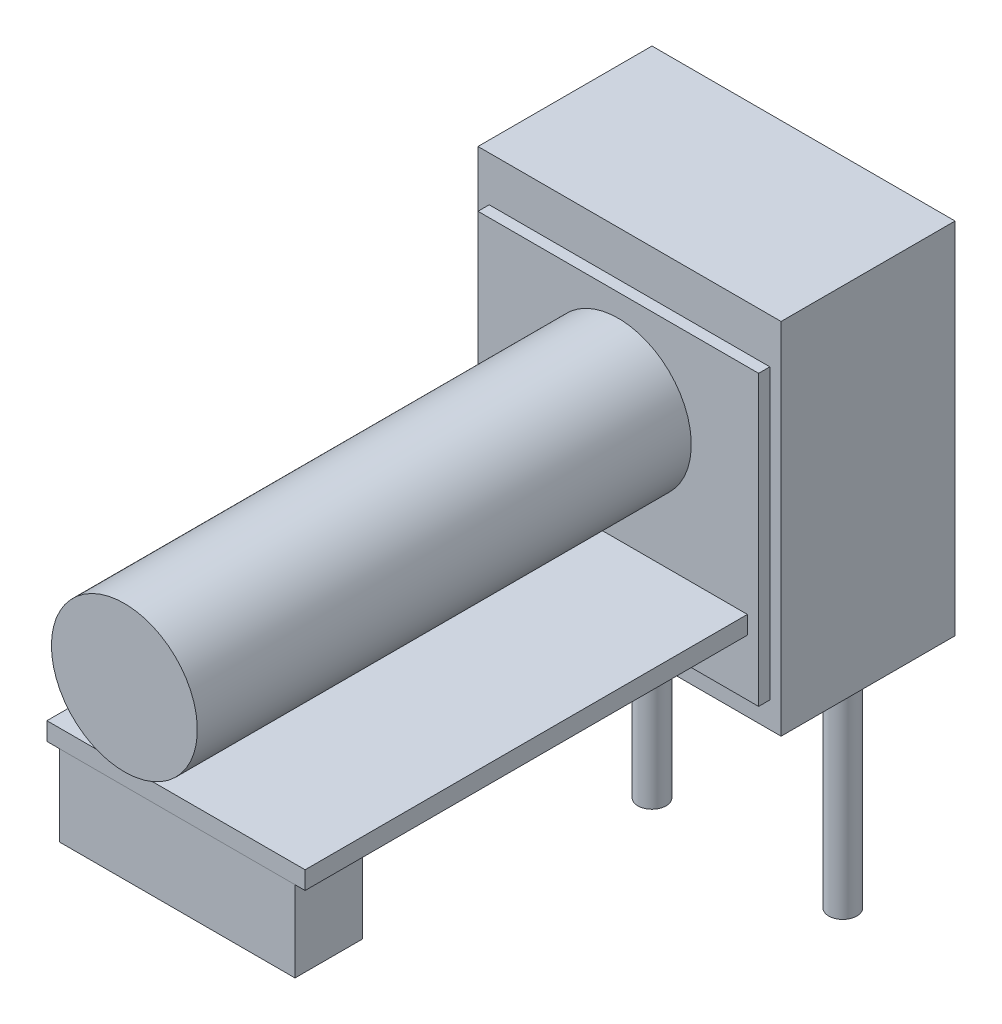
ISO-10303-21;
HEADER;
FILE_DESCRIPTION(('STEP AP214'),'2;1');
FILE_NAME('part.step','',(''),(''),'','','');
FILE_SCHEMA(('AUTOMOTIVE_DESIGN { 1 0 10303 214 1 1 1 1 }'));
ENDSEC;
DATA;
#1=APPLICATION_CONTEXT('core data for automotive mechanical design processes');
#2=APPLICATION_PROTOCOL_DEFINITION('international standard','automotive_design',2000,#1);
#3=PRODUCT_CONTEXT('',#1,'mechanical');
#4=PRODUCT('Part','Part','',(#3));
#5=PRODUCT_RELATED_PRODUCT_CATEGORY('part','',(#4));
#6=PRODUCT_DEFINITION_FORMATION('','',#4);
#7=PRODUCT_DEFINITION_CONTEXT('part definition',#1,'design');
#8=PRODUCT_DEFINITION('design','',#6,#7);
#9=PRODUCT_DEFINITION_SHAPE('','',#8);
#10=(LENGTH_UNIT() NAMED_UNIT(*) SI_UNIT(.MILLI.,.METRE.));
#11=(NAMED_UNIT(*) PLANE_ANGLE_UNIT() SI_UNIT($,.RADIAN.));
#12=(NAMED_UNIT(*) SI_UNIT($,.STERADIAN.) SOLID_ANGLE_UNIT());
#13=UNCERTAINTY_MEASURE_WITH_UNIT(LENGTH_MEASURE(1.E-05),#10,'distance_accuracy_value','');
#14=(GEOMETRIC_REPRESENTATION_CONTEXT(3) GLOBAL_UNCERTAINTY_ASSIGNED_CONTEXT((#13)) GLOBAL_UNIT_ASSIGNED_CONTEXT((#10,
#11,#12)) REPRESENTATION_CONTEXT('',''));
#15=CARTESIAN_POINT('',(0.,0.,0.));
#16=DIRECTION('',(0.,0.,1.));
#17=DIRECTION('',(1.,0.,0.));
#18=AXIS2_PLACEMENT_3D('',#15,#16,#17);
#19=CARTESIAN_POINT('',(50.2828220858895,2.57106339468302,5.));
#20=DIRECTION('',(0.,-1.,0.));
#21=DIRECTION('',(0.,0.,-1.));
#22=AXIS2_PLACEMENT_3D('',#19,#20,#21);
#23=PLANE('',#22);
#24=CARTESIAN_POINT('',(50.2828220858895,2.57106339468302,5.));
#25=DIRECTION('',(0.,-1.,0.));
#26=DIRECTION('',(0.,0.,-1.));
#27=AXIS2_PLACEMENT_3D('',#24,#25,#26);
#28=CIRCLE('',#27,3.2);
#29=CARTESIAN_POINT('',(50.2828220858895,2.57106339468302,1.8));
#30=VERTEX_POINT('',#29);
#31=EDGE_CURVE('E342',#30,#30,#28,.T.);
#32=ORIENTED_EDGE('',*,*,#31,.T.);
#33=EDGE_LOOP('',(#32));
#34=FACE_BOUND('',#33,.T.);
#35=CARTESIAN_POINT('',(50.2828220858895,2.57106339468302,5.));
#36=DIRECTION('',(0.,-1.,0.));
#37=DIRECTION('',(0.,0.,-1.));
#38=AXIS2_PLACEMENT_3D('',#35,#36,#37);
#39=CIRCLE('',#38,1.25);
#40=CARTESIAN_POINT('',(50.2828220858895,2.57106339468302,3.75000000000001));
#41=VERTEX_POINT('',#40);
#42=EDGE_CURVE('E710',#41,#41,#39,.T.);
#43=ORIENTED_EDGE('',*,*,#42,.F.);
#44=EDGE_LOOP('',(#43));
#45=FACE_BOUND('',#44,.T.);
#46=ADVANCED_FACE('F31',(#34,#45),#23,.T.);
#47=CARTESIAN_POINT('',(33.2828220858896,2.57106339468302,5.));
#48=DIRECTION('',(0.,-1.,0.));
#49=DIRECTION('',(0.,0.,-1.));
#50=AXIS2_PLACEMENT_3D('',#47,#48,#49);
#51=PLANE('',#50);
#52=CARTESIAN_POINT('',(33.2828220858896,2.57106339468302,5.));
#53=DIRECTION('',(0.,-1.,0.));
#54=DIRECTION('',(0.,0.,-1.));
#55=AXIS2_PLACEMENT_3D('',#52,#53,#54);
#56=CIRCLE('',#55,3.2);
#57=CARTESIAN_POINT('',(33.2828220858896,2.57106339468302,1.8));
#58=VERTEX_POINT('',#57);
#59=EDGE_CURVE('E348',#58,#58,#56,.T.);
#60=ORIENTED_EDGE('',*,*,#59,.T.);
#61=EDGE_LOOP('',(#60));
#62=FACE_BOUND('',#61,.T.);
#63=CARTESIAN_POINT('',(33.2828220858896,2.57106339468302,5.));
#64=DIRECTION('',(0.,-1.,0.));
#65=DIRECTION('',(0.,0.,-1.));
#66=AXIS2_PLACEMENT_3D('',#63,#64,#65);
#67=CIRCLE('',#66,1.25);
#68=CARTESIAN_POINT('',(33.2828220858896,2.57106339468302,3.75));
#69=VERTEX_POINT('',#68);
#70=EDGE_CURVE('E704',#69,#69,#67,.T.);
#71=ORIENTED_EDGE('',*,*,#70,.F.);
#72=EDGE_LOOP('',(#71));
#73=FACE_BOUND('',#72,.T.);
#74=ADVANCED_FACE('F743',(#62,#73),#51,.T.);
#75=CARTESIAN_POINT('',(28.2828220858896,3.57106339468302,15.5));
#76=DIRECTION('',(0.,1.,0.));
#77=DIRECTION('',(0.,0.,1.));
#78=AXIS2_PLACEMENT_3D('',#75,#76,#77);
#79=PLANE('',#78);
#80=CARTESIAN_POINT('',(50.2828220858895,3.57106339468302,5.));
#81=DIRECTION('',(0.,-1.,0.));
#82=DIRECTION('',(0.,0.,-1.));
#83=AXIS2_PLACEMENT_3D('',#80,#81,#82);
#84=CIRCLE('',#83,3.2);
#85=CARTESIAN_POINT('',(48.2828220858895,3.57106339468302,7.49799919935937));
#86=VERTEX_POINT('',#85);
#87=CARTESIAN_POINT('',(48.2828220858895,3.57106339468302,2.50200080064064));
#88=VERTEX_POINT('',#87);
#89=EDGE_CURVE('E1372',#86,#88,#84,.T.);
#90=ORIENTED_EDGE('',*,*,#89,.F.);
#91=DIRECTION('',(0.,0.,-1.));
#92=VECTOR('',#91,1.);
#93=CARTESIAN_POINT('',(48.2828220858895,3.57106339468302,6.13578166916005));
#94=LINE('',#93,#92);
#95=CARTESIAN_POINT('',(48.2828220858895,3.57106339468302,8.));
#96=VERTEX_POINT('',#95);
#97=EDGE_CURVE('E411',#96,#86,#94,.T.);
#98=ORIENTED_EDGE('',*,*,#97,.F.);
#99=CARTESIAN_POINT('',(50.2828220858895,3.57106339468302,8.));
#100=DIRECTION('',(0.,-1.,0.));
#101=DIRECTION('',(0.,0.,-1.));
#102=AXIS2_PLACEMENT_3D('',#99,#100,#101);
#103=CIRCLE('',#102,2.);
#104=CARTESIAN_POINT('',(52.2828220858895,3.57106339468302,8.));
#105=VERTEX_POINT('',#104);
#106=EDGE_CURVE('E408',#105,#96,#103,.T.);
#107=ORIENTED_EDGE('',*,*,#106,.F.);
#108=DIRECTION('',(0.,0.,1.));
#109=VECTOR('',#108,1.);
#110=CARTESIAN_POINT('',(52.2828220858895,3.57106339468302,6.13578166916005));
#111=LINE('',#110,#109);
#112=CARTESIAN_POINT('',(52.2828220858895,3.57106339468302,7.49799919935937));
#113=VERTEX_POINT('',#112);
#114=EDGE_CURVE('E54',#113,#105,#111,.T.);
#115=ORIENTED_EDGE('',*,*,#114,.F.);
#116=CARTESIAN_POINT('',(52.2828220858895,3.57106339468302,2.50200080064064));
#117=VERTEX_POINT('',#116);
#118=EDGE_CURVE('E49',#117,#113,#84,.T.);
#119=ORIENTED_EDGE('',*,*,#118,.F.);
#120=DIRECTION('',(0.,0.,1.));
#121=VECTOR('',#120,1.);
#122=CARTESIAN_POINT('',(52.2828220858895,3.57106339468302,0.));
#123=LINE('',#122,#121);
#124=CARTESIAN_POINT('',(52.2828220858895,3.57106339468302,0.));
#125=VERTEX_POINT('',#124);
#126=EDGE_CURVE('E337',#125,#117,#123,.T.);
#127=ORIENTED_EDGE('',*,*,#126,.F.);
#128=DIRECTION('',(1.,0.,0.));
#129=VECTOR('',#128,1.);
#130=CARTESIAN_POINT('',(28.2828220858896,3.57106339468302,0.));
#131=LINE('',#130,#129);
#132=CARTESIAN_POINT('',(55.2828220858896,3.57106339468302,0.));
#133=VERTEX_POINT('',#132);
#134=EDGE_CURVE('E619',#125,#133,#131,.T.);
#135=ORIENTED_EDGE('',*,*,#134,.T.);
#136=DIRECTION('',(0.,0.,-1.));
#137=VECTOR('',#136,1.);
#138=CARTESIAN_POINT('',(55.2828220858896,3.57106339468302,15.5));
#139=LINE('',#138,#137);
#140=CARTESIAN_POINT('',(55.2828220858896,3.57106339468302,15.5));
#141=VERTEX_POINT('',#140);
#142=EDGE_CURVE('E643',#141,#133,#139,.T.);
#143=ORIENTED_EDGE('',*,*,#142,.F.);
#144=DIRECTION('',(1.,0.,0.));
#145=VECTOR('',#144,1.);
#146=CARTESIAN_POINT('',(28.2828220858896,3.57106339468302,15.5));
#147=LINE('',#146,#145);
#148=CARTESIAN_POINT('',(28.2828220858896,3.57106339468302,15.5));
#149=VERTEX_POINT('',#148);
#150=EDGE_CURVE('E631',#149,#141,#147,.T.);
#151=ORIENTED_EDGE('',*,*,#150,.F.);
#152=DIRECTION('',(0.,0.,-1.));
#153=VECTOR('',#152,1.);
#154=CARTESIAN_POINT('',(28.2828220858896,3.57106339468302,15.5));
#155=LINE('',#154,#153);
#156=CARTESIAN_POINT('',(28.2828220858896,3.57106339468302,0.));
#157=VERTEX_POINT('',#156);
#158=EDGE_CURVE('E646',#149,#157,#155,.T.);
#159=ORIENTED_EDGE('',*,*,#158,.T.);
#160=CARTESIAN_POINT('',(31.2828220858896,3.57106339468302,0.));
#161=VERTEX_POINT('',#160);
#162=EDGE_CURVE('E620',#157,#161,#131,.T.);
#163=ORIENTED_EDGE('',*,*,#162,.T.);
#164=DIRECTION('',(0.,0.,-1.));
#165=VECTOR('',#164,1.);
#166=CARTESIAN_POINT('',(31.2828220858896,3.57106339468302,0.));
#167=LINE('',#166,#165);
#168=CARTESIAN_POINT('',(31.2828220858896,3.57106339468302,2.50200080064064));
#169=VERTEX_POINT('',#168);
#170=EDGE_CURVE('E460',#169,#161,#167,.T.);
#171=ORIENTED_EDGE('',*,*,#170,.F.);
#172=CARTESIAN_POINT('',(33.2828220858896,3.57106339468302,5.));
#173=DIRECTION('',(0.,-1.,0.));
#174=DIRECTION('',(0.,0.,-1.));
#175=AXIS2_PLACEMENT_3D('',#172,#173,#174);
#176=CIRCLE('',#175,3.2);
#177=CARTESIAN_POINT('',(31.2828220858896,3.57106339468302,7.49799919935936));
#178=VERTEX_POINT('',#177);
#179=EDGE_CURVE('E11',#178,#169,#176,.T.);
#180=ORIENTED_EDGE('',*,*,#179,.F.);
#181=DIRECTION('',(0.,0.,-1.));
#182=VECTOR('',#181,1.);
#183=CARTESIAN_POINT('',(31.2828220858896,3.57106339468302,6.13578166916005));
#184=LINE('',#183,#182);
#185=CARTESIAN_POINT('',(31.2828220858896,3.57106339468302,8.));
#186=VERTEX_POINT('',#185);
#187=EDGE_CURVE('E457',#186,#178,#184,.T.);
#188=ORIENTED_EDGE('',*,*,#187,.F.);
#189=CARTESIAN_POINT('',(33.2828220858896,3.57106339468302,8.));
#190=DIRECTION('',(0.,-1.,0.));
#191=DIRECTION('',(0.,0.,-1.));
#192=AXIS2_PLACEMENT_3D('',#189,#190,#191);
#193=CIRCLE('',#192,2.);
#194=CARTESIAN_POINT('',(35.2828220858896,3.57106339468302,8.));
#195=VERTEX_POINT('',#194);
#196=EDGE_CURVE('E453',#195,#186,#193,.T.);
#197=ORIENTED_EDGE('',*,*,#196,.F.);
#198=DIRECTION('',(0.,0.,1.));
#199=VECTOR('',#198,1.);
#200=CARTESIAN_POINT('',(35.2828220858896,3.57106339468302,6.13578166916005));
#201=LINE('',#200,#199);
#202=CARTESIAN_POINT('',(35.2828220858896,3.57106339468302,7.49799919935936));
#203=VERTEX_POINT('',#202);
#204=EDGE_CURVE('E449',#203,#195,#201,.T.);
#205=ORIENTED_EDGE('',*,*,#204,.F.);
#206=CARTESIAN_POINT('',(35.2828220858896,3.57106339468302,2.50200080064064));
#207=VERTEX_POINT('',#206);
#208=EDGE_CURVE('E41',#207,#203,#176,.T.);
#209=ORIENTED_EDGE('',*,*,#208,.F.);
#210=DIRECTION('',(0.,0.,1.));
#211=VECTOR('',#210,1.);
#212=CARTESIAN_POINT('',(35.2828220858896,3.57106339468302,0.));
#213=LINE('',#212,#211);
#214=CARTESIAN_POINT('',(35.2828220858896,3.57106339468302,0.));
#215=VERTEX_POINT('',#214);
#216=EDGE_CURVE('E446',#215,#207,#213,.T.);
#217=ORIENTED_EDGE('',*,*,#216,.F.);
#218=CARTESIAN_POINT('',(48.2828220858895,3.57106339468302,0.));
#219=VERTEX_POINT('',#218);
#220=EDGE_CURVE('E624',#215,#219,#131,.T.);
#221=ORIENTED_EDGE('',*,*,#220,.T.);
#222=DIRECTION('',(0.,0.,-1.));
#223=VECTOR('',#222,1.);
#224=CARTESIAN_POINT('',(48.2828220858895,3.57106339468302,0.));
#225=LINE('',#224,#223);
#226=EDGE_CURVE('E414',#88,#219,#225,.T.);
#227=ORIENTED_EDGE('',*,*,#226,.F.);
#228=EDGE_LOOP('',(#90,#98,#107,#115,#119,#127,#135,#143,#151,#159,#163,#171,#180,#188,#197,
#205,#209,#217,#221,#227));
#229=FACE_BOUND('',#228,.T.);
#230=ADVANCED_FACE('F680',(#229),#79,.F.);
#231=CARTESIAN_POINT('',(41.7828220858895,22.571063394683,10.));
#232=DIRECTION('',(0.,0.,-1.));
#233=DIRECTION('',(-1.,0.,0.));
#234=AXIS2_PLACEMENT_3D('',#231,#232,#233);
#235=PLANE('',#234);
#236=DIRECTION('',(-1.,0.,0.));
#237=VECTOR('',#236,1.);
#238=CARTESIAN_POINT('',(52.2828220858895,4.58623374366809,10.));
#239=LINE('',#238,#237);
#240=CARTESIAN_POINT('',(52.2828220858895,4.58623374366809,10.));
#241=VERTEX_POINT('',#240);
#242=CARTESIAN_POINT('',(50.2828220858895,4.58623374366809,10.));
#243=VERTEX_POINT('',#242);
#244=EDGE_CURVE('E506',#241,#243,#239,.T.);
#245=ORIENTED_EDGE('',*,*,#244,.T.);
#246=CARTESIAN_POINT('',(33.2828220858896,4.58623374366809,10.));
#247=VERTEX_POINT('',#246);
#248=EDGE_CURVE('E510',#243,#247,#239,.T.);
#249=ORIENTED_EDGE('',*,*,#248,.T.);
#250=CARTESIAN_POINT('',(31.2828220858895,4.58623374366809,10.));
#251=VERTEX_POINT('',#250);
#252=EDGE_CURVE('E505',#247,#251,#239,.T.);
#253=ORIENTED_EDGE('',*,*,#252,.T.);
#254=DIRECTION('',(0.,1.,0.));
#255=VECTOR('',#254,1.);
#256=CARTESIAN_POINT('',(31.2828220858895,16.7615883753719,10.));
#257=LINE('',#256,#255);
#258=CARTESIAN_POINT('',(31.2828220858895,16.7615883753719,10.));
#259=VERTEX_POINT('',#258);
#260=EDGE_CURVE('E496',#251,#259,#257,.T.);
#261=ORIENTED_EDGE('',*,*,#260,.T.);
#262=CARTESIAN_POINT('',(41.7828220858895,22.571063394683,10.));
#263=DIRECTION('',(0.,0.,-1.));
#264=DIRECTION('',(-1.,0.,0.));
#265=AXIS2_PLACEMENT_3D('',#262,#263,#264);
#266=CIRCLE('',#265,12.);
#267=CARTESIAN_POINT('',(52.2828220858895,16.7615883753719,10.));
#268=VERTEX_POINT('',#267);
#269=EDGE_CURVE('E499',#259,#268,#266,.T.);
#270=ORIENTED_EDGE('',*,*,#269,.T.);
#271=DIRECTION('',(0.,-1.,0.));
#272=VECTOR('',#271,1.);
#273=CARTESIAN_POINT('',(52.2828220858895,16.7615883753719,10.));
#274=LINE('',#273,#272);
#275=EDGE_CURVE('E502',#268,#241,#274,.T.);
#276=ORIENTED_EDGE('',*,*,#275,.T.);
#277=EDGE_LOOP('',(#245,#249,#253,#261,#270,#276));
#278=FACE_BOUND('',#277,.T.);
#279=DIRECTION('',(0.906801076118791,0.421558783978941,0.));
#280=VECTOR('',#279,1.);
#281=CARTESIAN_POINT('',(33.6905435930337,28.2514435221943,10.));
#282=LINE('',#281,#280);
#283=CARTESIAN_POINT('',(33.6905435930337,28.2514435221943,10.));
#284=VERTEX_POINT('',#283);
#285=CARTESIAN_POINT('',(42.6560363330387,32.4193722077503,10.));
#286=VERTEX_POINT('',#285);
#287=EDGE_CURVE('E365',#284,#286,#282,.T.);
#288=ORIENTED_EDGE('',*,*,#287,.F.);
#289=DIRECTION('',(0.0883199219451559,0.99609216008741,0.));
#290=VECTOR('',#289,1.);
#291=CARTESIAN_POINT('',(32.8173293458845,18.403134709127,10.));
#292=LINE('',#291,#290);
#293=CARTESIAN_POINT('',(32.8173293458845,18.403134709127,10.));
#294=VERTEX_POINT('',#293);
#295=EDGE_CURVE('E362',#294,#284,#292,.T.);
#296=ORIENTED_EDGE('',*,*,#295,.F.);
#297=DIRECTION('',(-0.818481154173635,0.574533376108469,0.));
#298=VECTOR('',#297,1.);
#299=CARTESIAN_POINT('',(40.9096078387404,12.7227545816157,10.));
#300=LINE('',#299,#298);
#301=CARTESIAN_POINT('',(40.9096078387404,12.7227545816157,10.));
#302=VERTEX_POINT('',#301);
#303=EDGE_CURVE('E374',#302,#294,#300,.T.);
#304=ORIENTED_EDGE('',*,*,#303,.F.);
#305=DIRECTION('',(-0.906801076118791,-0.42155878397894,0.));
#306=VECTOR('',#305,1.);
#307=CARTESIAN_POINT('',(49.8751005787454,16.8906832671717,10.));
#308=LINE('',#307,#306);
#309=CARTESIAN_POINT('',(49.8751005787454,16.8906832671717,10.));
#310=VERTEX_POINT('',#309);
#311=EDGE_CURVE('E371',#310,#302,#308,.T.);
#312=ORIENTED_EDGE('',*,*,#311,.F.);
#313=DIRECTION('',(-0.0883199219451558,-0.99609216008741,0.));
#314=VECTOR('',#313,1.);
#315=CARTESIAN_POINT('',(50.7483148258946,26.738992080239,10.));
#316=LINE('',#315,#314);
#317=CARTESIAN_POINT('',(50.7483148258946,26.738992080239,10.));
#318=VERTEX_POINT('',#317);
#319=EDGE_CURVE('E369',#318,#310,#316,.T.);
#320=ORIENTED_EDGE('',*,*,#319,.F.);
#321=DIRECTION('',(0.818481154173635,-0.574533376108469,0.));
#322=VECTOR('',#321,1.);
#323=CARTESIAN_POINT('',(42.6560363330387,32.4193722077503,10.));
#324=LINE('',#323,#322);
#325=EDGE_CURVE('E367',#286,#318,#324,.T.);
#326=ORIENTED_EDGE('',*,*,#325,.F.);
#327=EDGE_LOOP('',(#288,#296,#304,#312,#320,#326));
#328=FACE_BOUND('',#327,.T.);
#329=ADVANCED_FACE('F826',(#278,#328),#235,.T.);
#330=CARTESIAN_POINT('',(52.2828220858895,4.58623374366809,10.));
#331=DIRECTION('',(0.,-1.,0.));
#332=DIRECTION('',(1.,0.,0.));
#333=AXIS2_PLACEMENT_3D('',#330,#331,#332);
#334=PLANE('',#333);
#335=CARTESIAN_POINT('',(50.2828220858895,4.58623374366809,5.));
#336=DIRECTION('',(0.,-1.,0.));
#337=DIRECTION('',(1.,0.,0.));
#338=AXIS2_PLACEMENT_3D('',#335,#336,#337);
#339=CIRCLE('',#338,2.3);
#340=CARTESIAN_POINT('',(48.2828220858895,4.58623374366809,6.13578166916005));
#341=VERTEX_POINT('',#340);
#342=CARTESIAN_POINT('',(48.2828220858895,4.58623374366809,3.86421833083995));
#343=VERTEX_POINT('',#342);
#344=EDGE_CURVE('E442',#341,#343,#339,.T.);
#345=ORIENTED_EDGE('',*,*,#344,.T.);
#346=DIRECTION('',(0.,0.,-1.));
#347=VECTOR('',#346,1.);
#348=CARTESIAN_POINT('',(48.2828220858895,4.58623374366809,10.));
#349=LINE('',#348,#347);
#350=CARTESIAN_POINT('',(48.2828220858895,4.58623374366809,0.));
#351=VERTEX_POINT('',#350);
#352=EDGE_CURVE('E436',#343,#351,#349,.T.);
#353=ORIENTED_EDGE('',*,*,#352,.T.);
#354=DIRECTION('',(-1.,0.,0.));
#355=VECTOR('',#354,1.);
#356=CARTESIAN_POINT('',(52.2828220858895,4.58623374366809,0.));
#357=LINE('',#356,#355);
#358=CARTESIAN_POINT('',(35.2828220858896,4.58623374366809,0.));
#359=VERTEX_POINT('',#358);
#360=EDGE_CURVE('E494',#351,#359,#357,.T.);
#361=ORIENTED_EDGE('',*,*,#360,.T.);
#362=DIRECTION('',(0.,0.,1.));
#363=VECTOR('',#362,1.);
#364=CARTESIAN_POINT('',(35.2828220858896,4.58623374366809,10.));
#365=LINE('',#364,#363);
#366=CARTESIAN_POINT('',(35.2828220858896,4.58623374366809,3.86421833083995));
#367=VERTEX_POINT('',#366);
#368=EDGE_CURVE('E35',#359,#367,#365,.T.);
#369=ORIENTED_EDGE('',*,*,#368,.T.);
#370=CARTESIAN_POINT('',(33.2828220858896,4.58623374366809,5.));
#371=DIRECTION('',(0.,-1.,0.));
#372=DIRECTION('',(1.,0.,0.));
#373=AXIS2_PLACEMENT_3D('',#370,#371,#372);
#374=CIRCLE('',#373,2.3);
#375=CARTESIAN_POINT('',(35.2828220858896,4.58623374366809,6.13578166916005));
#376=VERTEX_POINT('',#375);
#377=EDGE_CURVE('E649',#367,#376,#374,.T.);
#378=ORIENTED_EDGE('',*,*,#377,.T.);
#379=DIRECTION('',(0.,0.,1.));
#380=VECTOR('',#379,1.);
#381=CARTESIAN_POINT('',(35.2828220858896,4.58623374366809,10.));
#382=LINE('',#381,#380);
#383=CARTESIAN_POINT('',(35.2828220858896,4.58623374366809,8.));
#384=VERTEX_POINT('',#383);
#385=EDGE_CURVE('E653',#376,#384,#382,.T.);
#386=ORIENTED_EDGE('',*,*,#385,.T.);
#387=CARTESIAN_POINT('',(33.2828220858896,4.58623374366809,8.));
#388=DIRECTION('',(0.,-1.,0.));
#389=DIRECTION('',(1.,0.,0.));
#390=AXIS2_PLACEMENT_3D('',#387,#388,#389);
#391=CIRCLE('',#390,2.);
#392=EDGE_CURVE('E483',#384,#247,#391,.T.);
#393=ORIENTED_EDGE('',*,*,#392,.T.);
#394=ORIENTED_EDGE('',*,*,#248,.F.);
#395=CARTESIAN_POINT('',(50.2828220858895,4.58623374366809,8.));
#396=DIRECTION('',(0.,-1.,0.));
#397=DIRECTION('',(1.,0.,0.));
#398=AXIS2_PLACEMENT_3D('',#395,#396,#397);
#399=CIRCLE('',#398,2.);
#400=CARTESIAN_POINT('',(48.2828220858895,4.58623374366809,8.));
#401=VERTEX_POINT('',#400);
#402=EDGE_CURVE('E432',#243,#401,#399,.T.);
#403=ORIENTED_EDGE('',*,*,#402,.T.);
#404=DIRECTION('',(0.,0.,-1.));
#405=VECTOR('',#404,1.);
#406=CARTESIAN_POINT('',(48.2828220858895,4.58623374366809,10.));
#407=LINE('',#406,#405);
#408=EDGE_CURVE('E439',#401,#341,#407,.T.);
#409=ORIENTED_EDGE('',*,*,#408,.T.);
#410=EDGE_LOOP('',(#345,#353,#361,#369,#378,#386,#393,#394,#403,#409));
#411=FACE_BOUND('',#410,.T.);
#412=ADVANCED_FACE('F659',(#411),#334,.F.);
#413=CARTESIAN_POINT('',(28.2828220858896,3.57106339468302,0.));
#414=DIRECTION('',(0.,0.,1.));
#415=DIRECTION('',(1.,0.,0.));
#416=AXIS2_PLACEMENT_3D('',#413,#414,#415);
#417=PLANE('',#416);
#418=ORIENTED_EDGE('',*,*,#134,.F.);
#419=DIRECTION('',(0.,-1.,0.));
#420=VECTOR('',#419,1.);
#421=CARTESIAN_POINT('',(52.2828220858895,16.7615883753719,0.));
#422=LINE('',#421,#420);
#423=CARTESIAN_POINT('',(52.2828220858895,16.7615883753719,0.));
#424=VERTEX_POINT('',#423);
#425=EDGE_CURVE('E492',#424,#125,#422,.T.);
#426=ORIENTED_EDGE('',*,*,#425,.F.);
#427=CARTESIAN_POINT('',(41.7828220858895,22.571063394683,0.));
#428=DIRECTION('',(0.,0.,-1.));
#429=DIRECTION('',(-1.,0.,0.));
#430=AXIS2_PLACEMENT_3D('',#427,#428,#429);
#431=CIRCLE('',#430,12.);
#432=CARTESIAN_POINT('',(31.2828220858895,16.7615883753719,0.));
#433=VERTEX_POINT('',#432);
#434=EDGE_CURVE('E489',#433,#424,#431,.T.);
#435=ORIENTED_EDGE('',*,*,#434,.F.);
#436=DIRECTION('',(0.,1.,0.));
#437=VECTOR('',#436,1.);
#438=CARTESIAN_POINT('',(31.2828220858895,16.7615883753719,0.));
#439=LINE('',#438,#437);
#440=EDGE_CURVE('E487',#161,#433,#439,.T.);
#441=ORIENTED_EDGE('',*,*,#440,.F.);
#442=ORIENTED_EDGE('',*,*,#162,.F.);
#443=DIRECTION('',(0.,-1.,0.));
#444=VECTOR('',#443,1.);
#445=CARTESIAN_POINT('',(28.2828220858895,35.571063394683,0.));
#446=LINE('',#445,#444);
#447=CARTESIAN_POINT('',(28.2828220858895,35.571063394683,0.));
#448=VERTEX_POINT('',#447);
#449=EDGE_CURVE('E616',#448,#157,#446,.T.);
#450=ORIENTED_EDGE('',*,*,#449,.F.);
#451=DIRECTION('',(-1.,0.,0.));
#452=VECTOR('',#451,1.);
#453=CARTESIAN_POINT('',(28.2828220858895,35.571063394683,0.));
#454=LINE('',#453,#452);
#455=CARTESIAN_POINT('',(55.2828220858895,35.571063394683,0.));
#456=VERTEX_POINT('',#455);
#457=EDGE_CURVE('E626',#456,#448,#454,.T.);
#458=ORIENTED_EDGE('',*,*,#457,.F.);
#459=DIRECTION('',(0.,1.,0.));
#460=VECTOR('',#459,1.);
#461=CARTESIAN_POINT('',(55.2828220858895,35.571063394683,0.));
#462=LINE('',#461,#460);
#463=EDGE_CURVE('E623',#133,#456,#462,.T.);
#464=ORIENTED_EDGE('',*,*,#463,.F.);
#465=EDGE_LOOP('',(#418,#426,#435,#441,#442,#450,#458,#464));
#466=FACE_BOUND('',#465,.T.);
#467=ADVANCED_FACE('F916',(#466),#417,.F.);
#468=DIRECTION('',(0.,0.,-1.));
#469=VECTOR('',#468,1.);
#470=CARTESIAN_POINT('',(52.2828220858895,4.58623374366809,10.));
#471=LINE('',#470,#469);
#472=CARTESIAN_POINT('',(52.2828220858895,4.58623374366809,8.));
#473=VERTEX_POINT('',#472);
#474=EDGE_CURVE('E515',#241,#473,#471,.T.);
#475=ORIENTED_EDGE('',*,*,#474,.T.);
#476=EDGE_CURVE('E435',#473,#243,#399,.T.);
#477=ORIENTED_EDGE('',*,*,#476,.T.);
#478=ORIENTED_EDGE('',*,*,#244,.F.);
#479=EDGE_LOOP('',(#475,#477,#478));
#480=FACE_BOUND('',#479,.T.);
#481=ADVANCED_FACE('F834',(#480),#334,.F.);
#482=CARTESIAN_POINT('',(30.2828220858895,10.871063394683,55.9));
#483=DIRECTION('',(0.,1.,0.));
#484=DIRECTION('',(0.,0.,1.));
#485=AXIS2_PLACEMENT_3D('',#482,#483,#484);
#486=PLANE('',#485);
#487=DIRECTION('',(1.,0.,0.));
#488=VECTOR('',#487,1.);
#489=CARTESIAN_POINT('',(30.2828220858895,10.871063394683,16.5));
#490=LINE('',#489,#488);
#491=CARTESIAN_POINT('',(30.2828220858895,10.871063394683,16.5));
#492=VERTEX_POINT('',#491);
#493=CARTESIAN_POINT('',(53.2828220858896,10.871063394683,16.5));
#494=VERTEX_POINT('',#493);
#495=EDGE_CURVE('E557',#492,#494,#490,.T.);
#496=ORIENTED_EDGE('',*,*,#495,.T.);
#497=DIRECTION('',(0.,0.,-1.));
#498=VECTOR('',#497,1.);
#499=CARTESIAN_POINT('',(53.2828220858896,10.871063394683,55.9));
#500=LINE('',#499,#498);
#501=CARTESIAN_POINT('',(53.2828220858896,10.871063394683,55.9));
#502=VERTEX_POINT('',#501);
#503=EDGE_CURVE('E578',#502,#494,#500,.T.);
#504=ORIENTED_EDGE('',*,*,#503,.F.);
#505=DIRECTION('',(1.,0.,0.));
#506=VECTOR('',#505,1.);
#507=CARTESIAN_POINT('',(30.2828220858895,10.871063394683,55.9));
#508=LINE('',#507,#506);
#509=CARTESIAN_POINT('',(30.2828220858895,10.871063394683,55.9));
#510=VERTEX_POINT('',#509);
#511=EDGE_CURVE('E567',#510,#502,#508,.T.);
#512=ORIENTED_EDGE('',*,*,#511,.F.);
#513=DIRECTION('',(0.,0.,-1.));
#514=VECTOR('',#513,1.);
#515=CARTESIAN_POINT('',(30.2828220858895,10.871063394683,55.9));
#516=LINE('',#515,#514);
#517=EDGE_CURVE('E581',#510,#492,#516,.T.);
#518=ORIENTED_EDGE('',*,*,#517,.T.);
#519=EDGE_LOOP('',(#496,#504,#512,#518));
#520=FACE_BOUND('',#519,.T.);
#521=DIRECTION('',(0.,0.,-1.));
#522=VECTOR('',#521,1.);
#523=CARTESIAN_POINT('',(31.2828220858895,10.871063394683,55.8));
#524=LINE('',#523,#522);
#525=CARTESIAN_POINT('',(31.2828220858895,10.871063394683,55.8));
#526=VERTEX_POINT('',#525);
#527=CARTESIAN_POINT('',(31.2828220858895,10.871063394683,49.8));
#528=VERTEX_POINT('',#527);
#529=EDGE_CURVE('E514',#526,#528,#524,.T.);
#530=ORIENTED_EDGE('',*,*,#529,.F.);
#531=DIRECTION('',(-1.,0.,0.));
#532=VECTOR('',#531,1.);
#533=CARTESIAN_POINT('',(31.2828220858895,10.871063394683,55.8));
#534=LINE('',#533,#532);
#535=CARTESIAN_POINT('',(52.2828220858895,10.871063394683,55.8));
#536=VERTEX_POINT('',#535);
#537=EDGE_CURVE('E530',#536,#526,#534,.T.);
#538=ORIENTED_EDGE('',*,*,#537,.F.);
#539=DIRECTION('',(0.,0.,1.));
#540=VECTOR('',#539,1.);
#541=CARTESIAN_POINT('',(52.2828220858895,10.871063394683,55.8));
#542=LINE('',#541,#540);
#543=CARTESIAN_POINT('',(52.2828220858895,10.871063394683,49.8));
#544=VERTEX_POINT('',#543);
#545=EDGE_CURVE('E527',#544,#536,#542,.T.);
#546=ORIENTED_EDGE('',*,*,#545,.F.);
#547=DIRECTION('',(1.,0.,0.));
#548=VECTOR('',#547,1.);
#549=CARTESIAN_POINT('',(31.2828220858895,10.871063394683,49.8));
#550=LINE('',#549,#548);
#551=EDGE_CURVE('E524',#528,#544,#550,.T.);
#552=ORIENTED_EDGE('',*,*,#551,.F.);
#553=EDGE_LOOP('',(#530,#538,#546,#552));
#554=FACE_BOUND('',#553,.T.);
#555=ADVANCED_FACE('F875',(#520,#554),#486,.F.);
#556=CARTESIAN_POINT('',(29.2828220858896,5.87106339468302,16.5));
#557=DIRECTION('',(0.,0.,1.));
#558=DIRECTION('',(1.,0.,0.));
#559=AXIS2_PLACEMENT_3D('',#556,#557,#558);
#560=PLANE('',#559);
#561=CARTESIAN_POINT('',(41.7828220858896,23.071063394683,16.5));
#562=DIRECTION('',(0.,0.,1.));
#563=DIRECTION('',(1.,0.,0.));
#564=AXIS2_PLACEMENT_3D('',#561,#562,#563);
#565=CIRCLE('',#564,6.5);
#566=CARTESIAN_POINT('',(35.2828220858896,23.071063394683,16.5));
#567=VERTEX_POINT('',#566);
#568=EDGE_CURVE('E612',#567,#567,#565,.T.);
#569=ORIENTED_EDGE('',*,*,#568,.F.);
#570=EDGE_LOOP('',(#569));
#571=FACE_BOUND('',#570,.T.);
#572=DIRECTION('',(0.,-1.,0.));
#573=VECTOR('',#572,1.);
#574=CARTESIAN_POINT('',(29.2828220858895,31.571063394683,16.5));
#575=LINE('',#574,#573);
#576=CARTESIAN_POINT('',(29.2828220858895,31.571063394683,16.5));
#577=VERTEX_POINT('',#576);
#578=CARTESIAN_POINT('',(29.2828220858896,5.87106339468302,16.5));
#579=VERTEX_POINT('',#578);
#580=EDGE_CURVE('E593',#577,#579,#575,.T.);
#581=ORIENTED_EDGE('',*,*,#580,.T.);
#582=DIRECTION('',(1.,0.,0.));
#583=VECTOR('',#582,1.);
#584=CARTESIAN_POINT('',(29.2828220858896,5.87106339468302,16.5));
#585=LINE('',#584,#583);
#586=CARTESIAN_POINT('',(54.2828220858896,5.87106339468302,16.5));
#587=VERTEX_POINT('',#586);
#588=EDGE_CURVE('E596',#579,#587,#585,.T.);
#589=ORIENTED_EDGE('',*,*,#588,.T.);
#590=DIRECTION('',(0.,1.,0.));
#591=VECTOR('',#590,1.);
#592=CARTESIAN_POINT('',(54.2828220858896,31.571063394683,16.5));
#593=LINE('',#592,#591);
#594=CARTESIAN_POINT('',(54.2828220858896,31.571063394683,16.5));
#595=VERTEX_POINT('',#594);
#596=EDGE_CURVE('E598',#587,#595,#593,.T.);
#597=ORIENTED_EDGE('',*,*,#596,.T.);
#598=DIRECTION('',(-1.,0.,0.));
#599=VECTOR('',#598,1.);
#600=CARTESIAN_POINT('',(29.2828220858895,31.571063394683,16.5));
#601=LINE('',#600,#599);
#602=EDGE_CURVE('E600',#595,#577,#601,.T.);
#603=ORIENTED_EDGE('',*,*,#602,.T.);
#604=EDGE_LOOP('',(#581,#589,#597,#603));
#605=FACE_BOUND('',#604,.T.);
#606=ORIENTED_EDGE('',*,*,#495,.F.);
#607=DIRECTION('',(0.,-1.,0.));
#608=VECTOR('',#607,1.);
#609=CARTESIAN_POINT('',(30.2828220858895,10.871063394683,16.5));
#610=LINE('',#609,#608);
#611=CARTESIAN_POINT('',(30.2828220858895,12.471063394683,16.5));
#612=VERTEX_POINT('',#611);
#613=EDGE_CURVE('E554',#612,#492,#610,.T.);
#614=ORIENTED_EDGE('',*,*,#613,.F.);
#615=DIRECTION('',(-1.,0.,0.));
#616=VECTOR('',#615,1.);
#617=CARTESIAN_POINT('',(30.2828220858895,12.471063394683,16.5));
#618=LINE('',#617,#616);
#619=CARTESIAN_POINT('',(53.2828220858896,12.471063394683,16.5));
#620=VERTEX_POINT('',#619);
#621=EDGE_CURVE('E562',#620,#612,#618,.T.);
#622=ORIENTED_EDGE('',*,*,#621,.F.);
#623=DIRECTION('',(0.,1.,0.));
#624=VECTOR('',#623,1.);
#625=CARTESIAN_POINT('',(53.2828220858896,10.871063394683,16.5));
#626=LINE('',#625,#624);
#627=EDGE_CURVE('E559',#494,#620,#626,.T.);
#628=ORIENTED_EDGE('',*,*,#627,.F.);
#629=EDGE_LOOP('',(#606,#614,#622,#628));
#630=FACE_BOUND('',#629,.T.);
#631=ADVANCED_FACE('F878',(#571,#605,#630),#560,.T.);
#632=CARTESIAN_POINT('',(28.2828220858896,3.57106339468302,15.5));
#633=DIRECTION('',(0.,0.,1.));
#634=DIRECTION('',(1.,0.,0.));
#635=AXIS2_PLACEMENT_3D('',#632,#633,#634);
#636=PLANE('',#635);
#637=DIRECTION('',(0.,-1.,0.));
#638=VECTOR('',#637,1.);
#639=CARTESIAN_POINT('',(28.2828220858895,35.571063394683,15.5));
#640=LINE('',#639,#638);
#641=CARTESIAN_POINT('',(28.2828220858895,35.571063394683,15.5));
#642=VERTEX_POINT('',#641);
#643=EDGE_CURVE('E628',#642,#149,#640,.T.);
#644=ORIENTED_EDGE('',*,*,#643,.T.);
#645=ORIENTED_EDGE('',*,*,#150,.T.);
#646=DIRECTION('',(0.,1.,0.));
#647=VECTOR('',#646,1.);
#648=CARTESIAN_POINT('',(55.2828220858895,35.571063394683,15.5));
#649=LINE('',#648,#647);
#650=CARTESIAN_POINT('',(55.2828220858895,35.571063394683,15.5));
#651=VERTEX_POINT('',#650);
#652=EDGE_CURVE('E633',#141,#651,#649,.T.);
#653=ORIENTED_EDGE('',*,*,#652,.T.);
#654=DIRECTION('',(-1.,0.,0.));
#655=VECTOR('',#654,1.);
#656=CARTESIAN_POINT('',(28.2828220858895,35.571063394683,15.5));
#657=LINE('',#656,#655);
#658=EDGE_CURVE('E635',#651,#642,#657,.T.);
#659=ORIENTED_EDGE('',*,*,#658,.T.);
#660=EDGE_LOOP('',(#644,#645,#653,#659));
#661=FACE_BOUND('',#660,.T.);
#662=DIRECTION('',(1.,0.,0.));
#663=VECTOR('',#662,1.);
#664=CARTESIAN_POINT('',(29.2828220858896,5.87106339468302,15.5));
#665=LINE('',#664,#663);
#666=CARTESIAN_POINT('',(29.2828220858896,5.87106339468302,15.5));
#667=VERTEX_POINT('',#666);
#668=CARTESIAN_POINT('',(54.2828220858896,5.87106339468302,15.5));
#669=VERTEX_POINT('',#668);
#670=EDGE_CURVE('E586',#667,#669,#665,.T.);
#671=ORIENTED_EDGE('',*,*,#670,.F.);
#672=DIRECTION('',(0.,-1.,0.));
#673=VECTOR('',#672,1.);
#674=CARTESIAN_POINT('',(29.2828220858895,31.571063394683,15.5));
#675=LINE('',#674,#673);
#676=CARTESIAN_POINT('',(29.2828220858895,31.571063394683,15.5));
#677=VERTEX_POINT('',#676);
#678=EDGE_CURVE('E583',#677,#667,#675,.T.);
#679=ORIENTED_EDGE('',*,*,#678,.F.);
#680=DIRECTION('',(-1.,0.,0.));
#681=VECTOR('',#680,1.);
#682=CARTESIAN_POINT('',(29.2828220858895,31.571063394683,15.5));
#683=LINE('',#682,#681);
#684=CARTESIAN_POINT('',(54.2828220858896,31.571063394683,15.5));
#685=VERTEX_POINT('',#684);
#686=EDGE_CURVE('E591',#685,#677,#683,.T.);
#687=ORIENTED_EDGE('',*,*,#686,.F.);
#688=DIRECTION('',(0.,1.,0.));
#689=VECTOR('',#688,1.);
#690=CARTESIAN_POINT('',(54.2828220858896,31.571063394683,15.5));
#691=LINE('',#690,#689);
#692=EDGE_CURVE('E588',#669,#685,#691,.T.);
#693=ORIENTED_EDGE('',*,*,#692,.F.);
#694=EDGE_LOOP('',(#671,#679,#687,#693));
#695=FACE_BOUND('',#694,.T.);
#696=ADVANCED_FACE('F886',(#661,#695),#636,.T.);
#697=CARTESIAN_POINT('',(28.2828220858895,35.571063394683,15.5));
#698=DIRECTION('',(1.,0.,0.));
#699=DIRECTION('',(0.,1.,0.));
#700=AXIS2_PLACEMENT_3D('',#697,#698,#699);
#701=PLANE('',#700);
#702=ORIENTED_EDGE('',*,*,#449,.T.);
#703=ORIENTED_EDGE('',*,*,#158,.F.);
#704=ORIENTED_EDGE('',*,*,#643,.F.);
#705=DIRECTION('',(0.,0.,-1.));
#706=VECTOR('',#705,1.);
#707=CARTESIAN_POINT('',(28.2828220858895,35.571063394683,15.5));
#708=LINE('',#707,#706);
#709=EDGE_CURVE('E637',#642,#448,#708,.T.);
#710=ORIENTED_EDGE('',*,*,#709,.T.);
#711=EDGE_LOOP('',(#702,#703,#704,#710));
#712=FACE_BOUND('',#711,.T.);
#713=ADVANCED_FACE('F33',(#712),#701,.F.);
#714=CARTESIAN_POINT('',(55.2828220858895,35.571063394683,15.5));
#715=DIRECTION('',(-1.,0.,0.));
#716=DIRECTION('',(0.,-1.,0.));
#717=AXIS2_PLACEMENT_3D('',#714,#715,#716);
#718=PLANE('',#717);
#719=ORIENTED_EDGE('',*,*,#463,.T.);
#720=DIRECTION('',(0.,0.,-1.));
#721=VECTOR('',#720,1.);
#722=CARTESIAN_POINT('',(55.2828220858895,35.571063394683,15.5));
#723=LINE('',#722,#721);
#724=EDGE_CURVE('E640',#651,#456,#723,.T.);
#725=ORIENTED_EDGE('',*,*,#724,.F.);
#726=ORIENTED_EDGE('',*,*,#652,.F.);
#727=ORIENTED_EDGE('',*,*,#142,.T.);
#728=EDGE_LOOP('',(#719,#725,#726,#727));
#729=FACE_BOUND('',#728,.T.);
#730=ADVANCED_FACE('F922',(#729),#718,.F.);
#731=CARTESIAN_POINT('',(28.2828220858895,35.571063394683,15.5));
#732=DIRECTION('',(0.,-1.,0.));
#733=DIRECTION('',(0.,0.,-1.));
#734=AXIS2_PLACEMENT_3D('',#731,#732,#733);
#735=PLANE('',#734);
#736=ORIENTED_EDGE('',*,*,#457,.T.);
#737=ORIENTED_EDGE('',*,*,#709,.F.);
#738=ORIENTED_EDGE('',*,*,#658,.F.);
#739=ORIENTED_EDGE('',*,*,#724,.T.);
#740=EDGE_LOOP('',(#736,#737,#738,#739));
#741=FACE_BOUND('',#740,.T.);
#742=ADVANCED_FACE('F914',(#741),#735,.F.);
#743=ORIENTED_EDGE('',*,*,#360,.F.);
#744=DIRECTION('',(0.,-1.,0.));
#745=VECTOR('',#744,1.);
#746=CARTESIAN_POINT('',(48.2828220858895,5.57106339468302,0.));
#747=LINE('',#746,#745);
#748=EDGE_CURVE('E416',#351,#219,#747,.T.);
#749=ORIENTED_EDGE('',*,*,#748,.T.);
#750=ORIENTED_EDGE('',*,*,#220,.F.);
#751=DIRECTION('',(0.,-1.,0.));
#752=VECTOR('',#751,1.);
#753=CARTESIAN_POINT('',(35.2828220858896,5.57106339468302,0.));
#754=LINE('',#753,#752);
#755=EDGE_CURVE('E464',#359,#215,#754,.T.);
#756=ORIENTED_EDGE('',*,*,#755,.F.);
#757=EDGE_LOOP('',(#743,#749,#750,#756));
#758=FACE_BOUND('',#757,.T.);
#759=ADVANCED_FACE('F904',(#758),#417,.F.);
#760=CARTESIAN_POINT('',(29.2828220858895,31.571063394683,16.5));
#761=DIRECTION('',(1.,0.,0.));
#762=DIRECTION('',(0.,1.,0.));
#763=AXIS2_PLACEMENT_3D('',#760,#761,#762);
#764=PLANE('',#763);
#765=ORIENTED_EDGE('',*,*,#678,.T.);
#766=DIRECTION('',(0.,0.,-1.));
#767=VECTOR('',#766,1.);
#768=CARTESIAN_POINT('',(29.2828220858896,5.87106339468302,16.5));
#769=LINE('',#768,#767);
#770=EDGE_CURVE('E610',#579,#667,#769,.T.);
#771=ORIENTED_EDGE('',*,*,#770,.F.);
#772=ORIENTED_EDGE('',*,*,#580,.F.);
#773=DIRECTION('',(0.,0.,-1.));
#774=VECTOR('',#773,1.);
#775=CARTESIAN_POINT('',(29.2828220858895,31.571063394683,16.5));
#776=LINE('',#775,#774);
#777=EDGE_CURVE('E602',#577,#677,#776,.T.);
#778=ORIENTED_EDGE('',*,*,#777,.T.);
#779=EDGE_LOOP('',(#765,#771,#772,#778));
#780=FACE_BOUND('',#779,.T.);
#781=ADVANCED_FACE('F900',(#780),#764,.F.);
#782=CARTESIAN_POINT('',(29.2828220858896,5.87106339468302,16.5));
#783=DIRECTION('',(0.,1.,0.));
#784=DIRECTION('',(0.,0.,1.));
#785=AXIS2_PLACEMENT_3D('',#782,#783,#784);
#786=PLANE('',#785);
#787=ORIENTED_EDGE('',*,*,#670,.T.);
#788=DIRECTION('',(0.,0.,-1.));
#789=VECTOR('',#788,1.);
#790=CARTESIAN_POINT('',(54.2828220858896,5.87106339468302,16.5));
#791=LINE('',#790,#789);
#792=EDGE_CURVE('E607',#587,#669,#791,.T.);
#793=ORIENTED_EDGE('',*,*,#792,.F.);
#794=ORIENTED_EDGE('',*,*,#588,.F.);
#795=ORIENTED_EDGE('',*,*,#770,.T.);
#796=EDGE_LOOP('',(#787,#793,#794,#795));
#797=FACE_BOUND('',#796,.T.);
#798=ADVANCED_FACE('F896',(#797),#786,.F.);
#799=CARTESIAN_POINT('',(54.2828220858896,31.571063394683,16.5));
#800=DIRECTION('',(-1.,0.,0.));
#801=DIRECTION('',(0.,0.,1.));
#802=AXIS2_PLACEMENT_3D('',#799,#800,#801);
#803=PLANE('',#802);
#804=ORIENTED_EDGE('',*,*,#692,.T.);
#805=DIRECTION('',(0.,0.,-1.));
#806=VECTOR('',#805,1.);
#807=CARTESIAN_POINT('',(54.2828220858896,31.571063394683,16.5));
#808=LINE('',#807,#806);
#809=EDGE_CURVE('E605',#595,#685,#808,.T.);
#810=ORIENTED_EDGE('',*,*,#809,.F.);
#811=ORIENTED_EDGE('',*,*,#596,.F.);
#812=ORIENTED_EDGE('',*,*,#792,.T.);
#813=EDGE_LOOP('',(#804,#810,#811,#812));
#814=FACE_BOUND('',#813,.T.);
#815=ADVANCED_FACE('F892',(#814),#803,.F.);
#816=CARTESIAN_POINT('',(29.2828220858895,31.571063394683,16.5));
#817=DIRECTION('',(0.,-1.,0.));
#818=DIRECTION('',(0.,0.,-1.));
#819=AXIS2_PLACEMENT_3D('',#816,#817,#818);
#820=PLANE('',#819);
#821=ORIENTED_EDGE('',*,*,#686,.T.);
#822=ORIENTED_EDGE('',*,*,#777,.F.);
#823=ORIENTED_EDGE('',*,*,#602,.F.);
#824=ORIENTED_EDGE('',*,*,#809,.T.);
#825=EDGE_LOOP('',(#821,#822,#823,#824));
#826=FACE_BOUND('',#825,.T.);
#827=ADVANCED_FACE('F888',(#826),#820,.F.);
#828=CARTESIAN_POINT('',(41.7828220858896,23.071063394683,60.5));
#829=DIRECTION('',(0.,0.,1.));
#830=DIRECTION('',(1.,0.,0.));
#831=AXIS2_PLACEMENT_3D('',#828,#829,#830);
#832=PLANE('',#831);
#833=CARTESIAN_POINT('',(41.7828220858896,23.071063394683,60.5));
#834=DIRECTION('',(0.,0.,1.));
#835=DIRECTION('',(1.,0.,0.));
#836=AXIS2_PLACEMENT_3D('',#833,#834,#835);
#837=CIRCLE('',#836,6.5);
#838=CARTESIAN_POINT('',(35.2828220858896,23.071063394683,60.5));
#839=VERTEX_POINT('',#838);
#840=EDGE_CURVE('E613',#839,#839,#837,.T.);
#841=ORIENTED_EDGE('',*,*,#840,.T.);
#842=EDGE_LOOP('',(#841));
#843=FACE_BOUND('',#842,.T.);
#844=ADVANCED_FACE('F891',(#843),#832,.T.);
#845=CARTESIAN_POINT('',(41.7828220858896,23.071063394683,60.5));
#846=DIRECTION('',(0.,0.,-1.));
#847=DIRECTION('',(-1.,0.,0.));
#848=AXIS2_PLACEMENT_3D('',#845,#846,#847);
#849=CYLINDRICAL_SURFACE('',#848,6.5);
#850=CARTESIAN_POINT('',(35.2828220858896,23.071063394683,16.5));
#851=CARTESIAN_POINT('',(35.2828220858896,23.071063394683,16.9583333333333));
#852=CARTESIAN_POINT('',(35.2828220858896,23.071063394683,17.4166666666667));
#853=CARTESIAN_POINT('',(35.2828220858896,23.071063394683,18.3333333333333));
#854=CARTESIAN_POINT('',(35.2828220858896,23.071063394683,18.7916666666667));
#855=CARTESIAN_POINT('',(35.2828220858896,23.071063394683,19.7083333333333));
#856=CARTESIAN_POINT('',(35.2828220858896,23.071063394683,20.1666666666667));
#857=CARTESIAN_POINT('',(35.2828220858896,23.071063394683,21.0833333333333));
#858=CARTESIAN_POINT('',(35.2828220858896,23.071063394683,21.5416666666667));
#859=CARTESIAN_POINT('',(35.2828220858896,23.071063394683,22.4583333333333));
#860=CARTESIAN_POINT('',(35.2828220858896,23.071063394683,22.9166666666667));
#861=CARTESIAN_POINT('',(35.2828220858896,23.071063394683,23.8333333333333));
#862=CARTESIAN_POINT('',(35.2828220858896,23.071063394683,24.2916666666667));
#863=CARTESIAN_POINT('',(35.2828220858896,23.071063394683,25.2083333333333));
#864=CARTESIAN_POINT('',(35.2828220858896,23.071063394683,25.6666666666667));
#865=CARTESIAN_POINT('',(35.2828220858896,23.071063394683,26.5833333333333));
#866=CARTESIAN_POINT('',(35.2828220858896,23.071063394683,27.0416666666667));
#867=CARTESIAN_POINT('',(35.2828220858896,23.071063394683,27.9583333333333));
#868=CARTESIAN_POINT('',(35.2828220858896,23.071063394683,28.4166666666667));
#869=CARTESIAN_POINT('',(35.2828220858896,23.071063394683,29.3333333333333));
#870=CARTESIAN_POINT('',(35.2828220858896,23.071063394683,29.7916666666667));
#871=CARTESIAN_POINT('',(35.2828220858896,23.071063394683,30.7083333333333));
#872=CARTESIAN_POINT('',(35.2828220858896,23.071063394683,31.1666666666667));
#873=CARTESIAN_POINT('',(35.2828220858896,23.071063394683,32.0833333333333));
#874=CARTESIAN_POINT('',(35.2828220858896,23.071063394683,32.5416666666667));
#875=CARTESIAN_POINT('',(35.2828220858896,23.071063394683,33.4583333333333));
#876=CARTESIAN_POINT('',(35.2828220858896,23.071063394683,33.9166666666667));
#877=CARTESIAN_POINT('',(35.2828220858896,23.071063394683,34.8333333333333));
#878=CARTESIAN_POINT('',(35.2828220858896,23.071063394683,35.2916666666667));
#879=CARTESIAN_POINT('',(35.2828220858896,23.071063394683,36.2083333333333));
#880=CARTESIAN_POINT('',(35.2828220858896,23.071063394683,36.6666666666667));
#881=CARTESIAN_POINT('',(35.2828220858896,23.071063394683,37.5833333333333));
#882=CARTESIAN_POINT('',(35.2828220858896,23.071063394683,38.0416666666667));
#883=CARTESIAN_POINT('',(35.2828220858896,23.071063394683,38.9583333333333));
#884=CARTESIAN_POINT('',(35.2828220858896,23.071063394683,39.4166666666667));
#885=CARTESIAN_POINT('',(35.2828220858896,23.071063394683,40.3333333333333));
#886=CARTESIAN_POINT('',(35.2828220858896,23.071063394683,40.7916666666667));
#887=CARTESIAN_POINT('',(35.2828220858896,23.071063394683,41.7083333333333));
#888=CARTESIAN_POINT('',(35.2828220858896,23.071063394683,42.1666666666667));
#889=CARTESIAN_POINT('',(35.2828220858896,23.071063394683,43.0833333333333));
#890=CARTESIAN_POINT('',(35.2828220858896,23.071063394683,43.5416666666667));
#891=CARTESIAN_POINT('',(35.2828220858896,23.071063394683,44.4583333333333));
#892=CARTESIAN_POINT('',(35.2828220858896,23.071063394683,44.9166666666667));
#893=CARTESIAN_POINT('',(35.2828220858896,23.071063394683,45.8333333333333));
#894=CARTESIAN_POINT('',(35.2828220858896,23.071063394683,46.2916666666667));
#895=CARTESIAN_POINT('',(35.2828220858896,23.071063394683,47.2083333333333));
#896=CARTESIAN_POINT('',(35.2828220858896,23.071063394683,47.6666666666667));
#897=CARTESIAN_POINT('',(35.2828220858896,23.071063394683,48.5833333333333));
#898=CARTESIAN_POINT('',(35.2828220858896,23.071063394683,49.0416666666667));
#899=CARTESIAN_POINT('',(35.2828220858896,23.071063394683,49.9583333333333));
#900=CARTESIAN_POINT('',(35.2828220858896,23.071063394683,50.4166666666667));
#901=CARTESIAN_POINT('',(35.2828220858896,23.071063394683,51.3333333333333));
#902=CARTESIAN_POINT('',(35.2828220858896,23.071063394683,51.7916666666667));
#903=CARTESIAN_POINT('',(35.2828220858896,23.071063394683,52.7083333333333));
#904=CARTESIAN_POINT('',(35.2828220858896,23.071063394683,53.1666666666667));
#905=CARTESIAN_POINT('',(35.2828220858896,23.071063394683,54.0833333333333));
#906=CARTESIAN_POINT('',(35.2828220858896,23.071063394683,54.5416666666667));
#907=CARTESIAN_POINT('',(35.2828220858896,23.071063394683,55.4583333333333));
#908=CARTESIAN_POINT('',(35.2828220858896,23.071063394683,55.9166666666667));
#909=CARTESIAN_POINT('',(35.2828220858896,23.071063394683,56.8333333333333));
#910=CARTESIAN_POINT('',(35.2828220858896,23.071063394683,57.2916666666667));
#911=CARTESIAN_POINT('',(35.2828220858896,23.071063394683,58.2083333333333));
#912=CARTESIAN_POINT('',(35.2828220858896,23.071063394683,58.6666666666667));
#913=CARTESIAN_POINT('',(35.2828220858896,23.071063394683,59.5833333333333));
#914=CARTESIAN_POINT('',(35.2828220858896,23.071063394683,60.0416666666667));
#915=CARTESIAN_POINT('',(35.2828220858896,23.071063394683,60.5));
#916=B_SPLINE_CURVE_WITH_KNOTS('',3,(#850,#851,#852,#853,#854,#855,#856,#857,#858,#859,#860,
#861,#862,#863,#864,#865,#866,#867,#868,#869,#870,#871,#872,#873,#874,#875,#876,#877,#878,#879,
#880,#881,#882,#883,#884,#885,#886,#887,#888,#889,#890,#891,#892,#893,#894,#895,#896,#897,#898,
#899,#900,#901,#902,#903,#904,#905,#906,#907,#908,#909,#910,#911,#912,#913,#914,#915),
.UNSPECIFIED.,.F.,.F.,(4,2,2,2,2,2,2,2,2,2,2,2,2,2,2,2,2,2,2,2,2,2,2,2,2,2,2,2,2,2,2,2,4),(0.,
1.375,2.75,4.125,5.5,6.875,8.25,9.625,11.,12.375,13.75,15.125,16.5,17.875,19.25,20.625,22.,
23.375,24.75,26.125,27.5,28.875,30.25,31.625,33.,34.375,35.75,37.125,38.5,39.875,41.25,42.625,
44.),.UNSPECIFIED.);
#917=EDGE_CURVE('BSEAM882',#567,#839,#916,.T.);
#918=ORIENTED_EDGE('',*,*,#568,.T.);
#919=ORIENTED_EDGE('',*,*,#840,.F.);
#920=ORIENTED_EDGE('',*,*,#917,.T.);
#921=ORIENTED_EDGE('',*,*,#917,.F.);
#922=EDGE_LOOP('',(#918,#920,#919,#921));
#923=FACE_BOUND('',#922,.T.);
#924=ADVANCED_FACE('F882',(#923),#849,.T.);
#925=CARTESIAN_POINT('',(30.2828220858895,10.871063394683,55.9));
#926=DIRECTION('',(1.,0.,0.));
#927=DIRECTION('',(0.,0.,-1.));
#928=AXIS2_PLACEMENT_3D('',#925,#926,#927);
#929=PLANE('',#928);
#930=ORIENTED_EDGE('',*,*,#613,.T.);
#931=ORIENTED_EDGE('',*,*,#517,.F.);
#932=DIRECTION('',(0.,-1.,0.));
#933=VECTOR('',#932,1.);
#934=CARTESIAN_POINT('',(30.2828220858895,10.871063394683,55.9));
#935=LINE('',#934,#933);
#936=CARTESIAN_POINT('',(30.2828220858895,12.471063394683,55.9));
#937=VERTEX_POINT('',#936);
#938=EDGE_CURVE('E564',#937,#510,#935,.T.);
#939=ORIENTED_EDGE('',*,*,#938,.F.);
#940=DIRECTION('',(0.,0.,-1.));
#941=VECTOR('',#940,1.);
#942=CARTESIAN_POINT('',(30.2828220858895,12.471063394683,55.9));
#943=LINE('',#942,#941);
#944=EDGE_CURVE('E573',#937,#612,#943,.T.);
#945=ORIENTED_EDGE('',*,*,#944,.T.);
#946=EDGE_LOOP('',(#930,#931,#939,#945));
#947=FACE_BOUND('',#946,.T.);
#948=ADVANCED_FACE('F873',(#947),#929,.F.);
#949=CARTESIAN_POINT('',(53.2828220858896,10.871063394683,55.9));
#950=DIRECTION('',(-1.,0.,0.));
#951=DIRECTION('',(0.,0.,1.));
#952=AXIS2_PLACEMENT_3D('',#949,#950,#951);
#953=PLANE('',#952);
#954=ORIENTED_EDGE('',*,*,#627,.T.);
#955=DIRECTION('',(0.,0.,-1.));
#956=VECTOR('',#955,1.);
#957=CARTESIAN_POINT('',(53.2828220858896,12.471063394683,55.9));
#958=LINE('',#957,#956);
#959=CARTESIAN_POINT('',(53.2828220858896,12.471063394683,55.9));
#960=VERTEX_POINT('',#959);
#961=EDGE_CURVE('E576',#960,#620,#958,.T.);
#962=ORIENTED_EDGE('',*,*,#961,.F.);
#963=DIRECTION('',(0.,1.,0.));
#964=VECTOR('',#963,1.);
#965=CARTESIAN_POINT('',(53.2828220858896,10.871063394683,55.9));
#966=LINE('',#965,#964);
#967=EDGE_CURVE('E569',#502,#960,#966,.T.);
#968=ORIENTED_EDGE('',*,*,#967,.F.);
#969=ORIENTED_EDGE('',*,*,#503,.T.);
#970=EDGE_LOOP('',(#954,#962,#968,#969));
#971=FACE_BOUND('',#970,.T.);
#972=ADVANCED_FACE('F869',(#971),#953,.F.);
#973=CARTESIAN_POINT('',(30.2828220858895,12.471063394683,55.9));
#974=DIRECTION('',(0.,-1.,0.));
#975=DIRECTION('',(0.,0.,-1.));
#976=AXIS2_PLACEMENT_3D('',#973,#974,#975);
#977=PLANE('',#976);
#978=ORIENTED_EDGE('',*,*,#621,.T.);
#979=ORIENTED_EDGE('',*,*,#944,.F.);
#980=DIRECTION('',(-1.,0.,0.));
#981=VECTOR('',#980,1.);
#982=CARTESIAN_POINT('',(30.2828220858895,12.471063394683,55.9));
#983=LINE('',#982,#981);
#984=EDGE_CURVE('E571',#960,#937,#983,.T.);
#985=ORIENTED_EDGE('',*,*,#984,.F.);
#986=ORIENTED_EDGE('',*,*,#961,.T.);
#987=EDGE_LOOP('',(#978,#979,#985,#986));
#988=FACE_BOUND('',#987,.T.);
#989=ADVANCED_FACE('F865',(#988),#977,.F.);
#990=CARTESIAN_POINT('',(30.2828220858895,12.471063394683,55.9));
#991=DIRECTION('',(0.,0.,-1.));
#992=DIRECTION('',(-1.,0.,0.));
#993=AXIS2_PLACEMENT_3D('',#990,#991,#992);
#994=PLANE('',#993);
#995=ORIENTED_EDGE('',*,*,#938,.T.);
#996=ORIENTED_EDGE('',*,*,#511,.T.);
#997=ORIENTED_EDGE('',*,*,#967,.T.);
#998=ORIENTED_EDGE('',*,*,#984,.T.);
#999=EDGE_LOOP('',(#995,#996,#997,#998));
#1000=FACE_BOUND('',#999,.T.);
#1001=ADVANCED_FACE('F861',(#1000),#994,.F.);
#1002=CARTESIAN_POINT('',(31.2828220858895,3.57106339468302,55.8));
#1003=DIRECTION('',(1.,0.,0.));
#1004=DIRECTION('',(0.,0.,-1.));
#1005=AXIS2_PLACEMENT_3D('',#1002,#1003,#1004);
#1006=PLANE('',#1005);
#1007=ORIENTED_EDGE('',*,*,#529,.T.);
#1008=DIRECTION('',(0.,1.,0.));
#1009=VECTOR('',#1008,1.);
#1010=CARTESIAN_POINT('',(31.2828220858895,3.57106339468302,49.8));
#1011=LINE('',#1010,#1009);
#1012=CARTESIAN_POINT('',(31.2828220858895,3.57106339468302,49.8));
#1013=VERTEX_POINT('',#1012);
#1014=EDGE_CURVE('E551',#1013,#528,#1011,.T.);
#1015=ORIENTED_EDGE('',*,*,#1014,.F.);
#1016=DIRECTION('',(0.,0.,-1.));
#1017=VECTOR('',#1016,1.);
#1018=CARTESIAN_POINT('',(31.2828220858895,3.57106339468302,55.8));
#1019=LINE('',#1018,#1017);
#1020=CARTESIAN_POINT('',(31.2828220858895,3.57106339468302,55.8));
#1021=VERTEX_POINT('',#1020);
#1022=EDGE_CURVE('E533',#1021,#1013,#1019,.T.);
#1023=ORIENTED_EDGE('',*,*,#1022,.F.);
#1024=DIRECTION('',(0.,1.,0.));
#1025=VECTOR('',#1024,1.);
#1026=CARTESIAN_POINT('',(31.2828220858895,3.57106339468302,55.8));
#1027=LINE('',#1026,#1025);
#1028=EDGE_CURVE('E542',#1021,#526,#1027,.T.);
#1029=ORIENTED_EDGE('',*,*,#1028,.T.);
#1030=EDGE_LOOP('',(#1007,#1015,#1023,#1029));
#1031=FACE_BOUND('',#1030,.T.);
#1032=ADVANCED_FACE('F857',(#1031),#1006,.F.);
#1033=CARTESIAN_POINT('',(31.2828220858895,3.57106339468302,49.8));
#1034=DIRECTION('',(0.,0.,1.));
#1035=DIRECTION('',(1.,0.,0.));
#1036=AXIS2_PLACEMENT_3D('',#1033,#1034,#1035);
#1037=PLANE('',#1036);
#1038=ORIENTED_EDGE('',*,*,#551,.T.);
#1039=DIRECTION('',(0.,1.,0.));
#1040=VECTOR('',#1039,1.);
#1041=CARTESIAN_POINT('',(52.2828220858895,3.57106339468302,49.8));
#1042=LINE('',#1041,#1040);
#1043=CARTESIAN_POINT('',(52.2828220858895,3.57106339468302,49.8));
#1044=VERTEX_POINT('',#1043);
#1045=EDGE_CURVE('E548',#1044,#544,#1042,.T.);
#1046=ORIENTED_EDGE('',*,*,#1045,.F.);
#1047=DIRECTION('',(1.,0.,0.));
#1048=VECTOR('',#1047,1.);
#1049=CARTESIAN_POINT('',(31.2828220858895,3.57106339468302,49.8));
#1050=LINE('',#1049,#1048);
#1051=EDGE_CURVE('E536',#1013,#1044,#1050,.T.);
#1052=ORIENTED_EDGE('',*,*,#1051,.F.);
#1053=ORIENTED_EDGE('',*,*,#1014,.T.);
#1054=EDGE_LOOP('',(#1038,#1046,#1052,#1053));
#1055=FACE_BOUND('',#1054,.T.);
#1056=ADVANCED_FACE('F853',(#1055),#1037,.F.);
#1057=CARTESIAN_POINT('',(52.2828220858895,3.57106339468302,55.8));
#1058=DIRECTION('',(-1.,0.,0.));
#1059=DIRECTION('',(0.,0.,1.));
#1060=AXIS2_PLACEMENT_3D('',#1057,#1058,#1059);
#1061=PLANE('',#1060);
#1062=ORIENTED_EDGE('',*,*,#545,.T.);
#1063=DIRECTION('',(0.,1.,0.));
#1064=VECTOR('',#1063,1.);
#1065=CARTESIAN_POINT('',(52.2828220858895,3.57106339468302,55.8));
#1066=LINE('',#1065,#1064);
#1067=CARTESIAN_POINT('',(52.2828220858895,3.57106339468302,55.8));
#1068=VERTEX_POINT('',#1067);
#1069=EDGE_CURVE('E545',#1068,#536,#1066,.T.);
#1070=ORIENTED_EDGE('',*,*,#1069,.F.);
#1071=DIRECTION('',(0.,0.,1.));
#1072=VECTOR('',#1071,1.);
#1073=CARTESIAN_POINT('',(52.2828220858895,3.57106339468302,55.8));
#1074=LINE('',#1073,#1072);
#1075=EDGE_CURVE('E538',#1044,#1068,#1074,.T.);
#1076=ORIENTED_EDGE('',*,*,#1075,.F.);
#1077=ORIENTED_EDGE('',*,*,#1045,.T.);
#1078=EDGE_LOOP('',(#1062,#1070,#1076,#1077));
#1079=FACE_BOUND('',#1078,.T.);
#1080=ADVANCED_FACE('F849',(#1079),#1061,.F.);
#1081=CARTESIAN_POINT('',(31.2828220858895,3.57106339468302,55.8));
#1082=DIRECTION('',(0.,0.,-1.));
#1083=DIRECTION('',(-1.,0.,0.));
#1084=AXIS2_PLACEMENT_3D('',#1081,#1082,#1083);
#1085=PLANE('',#1084);
#1086=ORIENTED_EDGE('',*,*,#537,.T.);
#1087=ORIENTED_EDGE('',*,*,#1028,.F.);
#1088=DIRECTION('',(-1.,0.,0.));
#1089=VECTOR('',#1088,1.);
#1090=CARTESIAN_POINT('',(31.2828220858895,3.57106339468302,55.8));
#1091=LINE('',#1090,#1089);
#1092=EDGE_CURVE('E540',#1068,#1021,#1091,.T.);
#1093=ORIENTED_EDGE('',*,*,#1092,.F.);
#1094=ORIENTED_EDGE('',*,*,#1069,.T.);
#1095=EDGE_LOOP('',(#1086,#1087,#1093,#1094));
#1096=FACE_BOUND('',#1095,.T.);
#1097=ADVANCED_FACE('F845',(#1096),#1085,.F.);
#1098=CARTESIAN_POINT('',(31.2828220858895,3.57106339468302,49.8));
#1099=DIRECTION('',(0.,-1.,0.));
#1100=DIRECTION('',(0.,0.,-1.));
#1101=AXIS2_PLACEMENT_3D('',#1098,#1099,#1100);
#1102=PLANE('',#1101);
#1103=ORIENTED_EDGE('',*,*,#1022,.T.);
#1104=ORIENTED_EDGE('',*,*,#1051,.T.);
#1105=ORIENTED_EDGE('',*,*,#1075,.T.);
#1106=ORIENTED_EDGE('',*,*,#1092,.T.);
#1107=EDGE_LOOP('',(#1103,#1104,#1105,#1106));
#1108=FACE_BOUND('',#1107,.T.);
#1109=ADVANCED_FACE('F842',(#1108),#1102,.T.);
#1110=CARTESIAN_POINT('',(31.2828220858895,16.7615883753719,10.));
#1111=DIRECTION('',(-1.,0.,0.));
#1112=DIRECTION('',(0.,0.,1.));
#1113=AXIS2_PLACEMENT_3D('',#1110,#1111,#1112);
#1114=PLANE('',#1113);
#1115=DIRECTION('',(0.,0.,-1.));
#1116=VECTOR('',#1115,1.);
#1117=CARTESIAN_POINT('',(31.2828220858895,4.58623374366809,10.));
#1118=LINE('',#1117,#1116);
#1119=CARTESIAN_POINT('',(31.2828220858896,4.58623374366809,8.));
#1120=VERTEX_POINT('',#1119);
#1121=EDGE_CURVE('E511',#251,#1120,#1118,.T.);
#1122=ORIENTED_EDGE('',*,*,#1121,.T.);
#1123=DIRECTION('',(0.,-1.,0.));
#1124=VECTOR('',#1123,1.);
#1125=CARTESIAN_POINT('',(31.2828220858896,5.57106339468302,8.));
#1126=LINE('',#1125,#1124);
#1127=EDGE_CURVE('E472',#1120,#186,#1126,.T.);
#1128=ORIENTED_EDGE('',*,*,#1127,.T.);
#1129=ORIENTED_EDGE('',*,*,#187,.T.);
#1130=CARTESIAN_POINT('',(31.2828220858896,3.57106339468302,6.13578166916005));
#1131=VERTEX_POINT('',#1130);
#1132=EDGE_CURVE('E456',#178,#1131,#184,.T.);
#1133=ORIENTED_EDGE('',*,*,#1132,.T.);
#1134=DIRECTION('',(0.,-1.,0.));
#1135=VECTOR('',#1134,1.);
#1136=CARTESIAN_POINT('',(31.2828220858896,5.57106339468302,6.13578166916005));
#1137=LINE('',#1136,#1135);
#1138=CARTESIAN_POINT('',(31.2828220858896,5.57106339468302,6.13578166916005));
#1139=VERTEX_POINT('',#1138);
#1140=EDGE_CURVE('E469',#1139,#1131,#1137,.T.);
#1141=ORIENTED_EDGE('',*,*,#1140,.F.);
#1142=DIRECTION('',(0.,0.,1.));
#1143=VECTOR('',#1142,1.);
#1144=CARTESIAN_POINT('',(31.2828220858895,5.57106339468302,10.));
#1145=LINE('',#1144,#1143);
#1146=CARTESIAN_POINT('',(31.2828220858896,5.57106339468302,3.86421833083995));
#1147=VERTEX_POINT('',#1146);
#1148=EDGE_CURVE('E466',#1147,#1139,#1145,.T.);
#1149=ORIENTED_EDGE('',*,*,#1148,.F.);
#1150=DIRECTION('',(0.,-1.,0.));
#1151=VECTOR('',#1150,1.);
#1152=CARTESIAN_POINT('',(31.2828220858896,5.57106339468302,3.86421833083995));
#1153=LINE('',#1152,#1151);
#1154=CARTESIAN_POINT('',(31.2828220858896,3.57106339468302,3.86421833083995));
#1155=VERTEX_POINT('',#1154);
#1156=EDGE_CURVE('E467',#1147,#1155,#1153,.T.);
#1157=ORIENTED_EDGE('',*,*,#1156,.T.);
#1158=EDGE_CURVE('E461',#1155,#169,#167,.T.);
#1159=ORIENTED_EDGE('',*,*,#1158,.T.);
#1160=ORIENTED_EDGE('',*,*,#170,.T.);
#1161=ORIENTED_EDGE('',*,*,#440,.T.);
#1162=DIRECTION('',(0.,0.,-1.));
#1163=VECTOR('',#1162,1.);
#1164=CARTESIAN_POINT('',(31.2828220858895,16.7615883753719,10.));
#1165=LINE('',#1164,#1163);
#1166=EDGE_CURVE('E509',#259,#433,#1165,.T.);
#1167=ORIENTED_EDGE('',*,*,#1166,.F.);
#1168=ORIENTED_EDGE('',*,*,#260,.F.);
#1169=EDGE_LOOP('',(#1122,#1128,#1129,#1133,#1141,#1149,#1157,#1159,#1160,#1161,#1167,#1168));
#1170=FACE_BOUND('',#1169,.T.);
#1171=ADVANCED_FACE('F684',(#1170),#1114,.F.);
#1172=ORIENTED_EDGE('',*,*,#252,.F.);
#1173=EDGE_CURVE('E486',#247,#1120,#391,.T.);
#1174=ORIENTED_EDGE('',*,*,#1173,.T.);
#1175=ORIENTED_EDGE('',*,*,#1121,.F.);
#1176=EDGE_LOOP('',(#1172,#1174,#1175));
#1177=FACE_BOUND('',#1176,.T.);
#1178=ADVANCED_FACE('F830',(#1177),#334,.F.);
#1179=CARTESIAN_POINT('',(52.2828220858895,16.7615883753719,10.));
#1180=DIRECTION('',(1.,0.,0.));
#1181=DIRECTION('',(0.,1.,0.));
#1182=AXIS2_PLACEMENT_3D('',#1179,#1180,#1181);
#1183=PLANE('',#1182);
#1184=DIRECTION('',(0.,-1.,0.));
#1185=VECTOR('',#1184,1.);
#1186=CARTESIAN_POINT('',(52.2828220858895,5.57106339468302,6.13578166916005));
#1187=LINE('',#1186,#1185);
#1188=CARTESIAN_POINT('',(52.2828220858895,5.57106339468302,6.13578166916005));
#1189=VERTEX_POINT('',#1188);
#1190=CARTESIAN_POINT('',(52.2828220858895,3.57106339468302,6.13578166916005));
#1191=VERTEX_POINT('',#1190);
#1192=EDGE_CURVE('E331',#1189,#1191,#1187,.T.);
#1193=ORIENTED_EDGE('',*,*,#1192,.T.);
#1194=EDGE_CURVE('E406',#1191,#113,#111,.T.);
#1195=ORIENTED_EDGE('',*,*,#1194,.T.);
#1196=ORIENTED_EDGE('',*,*,#114,.T.);
#1197=DIRECTION('',(0.,-1.,0.));
#1198=VECTOR('',#1197,1.);
#1199=CARTESIAN_POINT('',(52.2828220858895,5.57106339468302,8.));
#1200=LINE('',#1199,#1198);
#1201=EDGE_CURVE('E427',#473,#105,#1200,.T.);
#1202=ORIENTED_EDGE('',*,*,#1201,.F.);
#1203=ORIENTED_EDGE('',*,*,#474,.F.);
#1204=ORIENTED_EDGE('',*,*,#275,.F.);
#1205=DIRECTION('',(0.,0.,-1.));
#1206=VECTOR('',#1205,1.);
#1207=CARTESIAN_POINT('',(52.2828220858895,16.7615883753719,10.));
#1208=LINE('',#1207,#1206);
#1209=EDGE_CURVE('E518',#268,#424,#1208,.T.);
#1210=ORIENTED_EDGE('',*,*,#1209,.T.);
#1211=ORIENTED_EDGE('',*,*,#425,.T.);
#1212=ORIENTED_EDGE('',*,*,#126,.T.);
#1213=DIRECTION('',(0.,0.,-1.));
#1214=VECTOR('',#1213,1.);
#1215=CARTESIAN_POINT('',(52.2828220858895,3.57106339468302,10.));
#1216=LINE('',#1215,#1214);
#1217=CARTESIAN_POINT('',(52.2828220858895,3.57106339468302,3.86421833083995));
#1218=VERTEX_POINT('',#1217);
#1219=EDGE_CURVE('E335',#1218,#117,#1216,.T.);
#1220=ORIENTED_EDGE('',*,*,#1219,.F.);
#1221=DIRECTION('',(0.,-1.,0.));
#1222=VECTOR('',#1221,1.);
#1223=CARTESIAN_POINT('',(52.2828220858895,5.57106339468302,3.86421833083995));
#1224=LINE('',#1223,#1222);
#1225=CARTESIAN_POINT('',(52.2828220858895,5.57106339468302,3.86421833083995));
#1226=VERTEX_POINT('',#1225);
#1227=EDGE_CURVE('E320',#1226,#1218,#1224,.T.);
#1228=ORIENTED_EDGE('',*,*,#1227,.F.);
#1229=DIRECTION('',(0.,0.,-1.));
#1230=VECTOR('',#1229,1.);
#1231=CARTESIAN_POINT('',(52.2828220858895,5.57106339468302,10.));
#1232=LINE('',#1231,#1230);
#1233=EDGE_CURVE('E419',#1189,#1226,#1232,.T.);
#1234=ORIENTED_EDGE('',*,*,#1233,.F.);
#1235=EDGE_LOOP('',(#1193,#1195,#1196,#1202,#1203,#1204,#1210,#1211,#1212,#1220,#1228,#1234));
#1236=FACE_BOUND('',#1235,.T.);
#1237=ADVANCED_FACE('F336',(#1236),#1183,.F.);
#1238=CARTESIAN_POINT('',(41.7828220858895,22.571063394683,10.));
#1239=DIRECTION('',(0.,0.,-1.));
#1240=DIRECTION('',(-1.,0.,0.));
#1241=AXIS2_PLACEMENT_3D('',#1238,#1239,#1240);
#1242=CYLINDRICAL_SURFACE('',#1241,12.);
#1243=ORIENTED_EDGE('',*,*,#434,.T.);
#1244=ORIENTED_EDGE('',*,*,#1209,.F.);
#1245=ORIENTED_EDGE('',*,*,#269,.F.);
#1246=ORIENTED_EDGE('',*,*,#1166,.T.);
#1247=EDGE_LOOP('',(#1243,#1244,#1245,#1246));
#1248=FACE_BOUND('',#1247,.T.);
#1249=ADVANCED_FACE('F825',(#1248),#1242,.F.);
#1250=CARTESIAN_POINT('',(35.2828220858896,5.57106339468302,0.));
#1251=DIRECTION('',(1.,0.,0.));
#1252=DIRECTION('',(0.,0.,-1.));
#1253=AXIS2_PLACEMENT_3D('',#1250,#1251,#1252);
#1254=PLANE('',#1253);
#1255=ORIENTED_EDGE('',*,*,#755,.T.);
#1256=ORIENTED_EDGE('',*,*,#216,.T.);
#1257=CARTESIAN_POINT('',(35.2828220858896,3.57106339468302,3.86421833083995));
#1258=VERTEX_POINT('',#1257);
#1259=EDGE_CURVE('E445',#207,#1258,#213,.T.);
#1260=ORIENTED_EDGE('',*,*,#1259,.T.);
#1261=DIRECTION('',(0.,-1.,0.));
#1262=VECTOR('',#1261,1.);
#1263=CARTESIAN_POINT('',(35.2828220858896,5.57106339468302,3.86421833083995));
#1264=LINE('',#1263,#1262);
#1265=EDGE_CURVE('E463',#367,#1258,#1264,.T.);
#1266=ORIENTED_EDGE('',*,*,#1265,.F.);
#1267=ORIENTED_EDGE('',*,*,#368,.F.);
#1268=EDGE_LOOP('',(#1255,#1256,#1260,#1266,#1267));
#1269=FACE_BOUND('',#1268,.T.);
#1270=ADVANCED_FACE('F822',(#1269),#1254,.F.);
#1271=CARTESIAN_POINT('',(35.2828220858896,5.57106339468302,6.13578166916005));
#1272=DIRECTION('',(1.,0.,0.));
#1273=DIRECTION('',(0.,0.,-1.));
#1274=AXIS2_PLACEMENT_3D('',#1271,#1272,#1273);
#1275=PLANE('',#1274);
#1276=DIRECTION('',(0.,-1.,0.));
#1277=VECTOR('',#1276,1.);
#1278=CARTESIAN_POINT('',(35.2828220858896,5.57106339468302,6.13578166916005));
#1279=LINE('',#1278,#1277);
#1280=CARTESIAN_POINT('',(35.2828220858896,3.57106339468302,6.13578166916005));
#1281=VERTEX_POINT('',#1280);
#1282=EDGE_CURVE('E477',#376,#1281,#1279,.T.);
#1283=ORIENTED_EDGE('',*,*,#1282,.T.);
#1284=EDGE_CURVE('E450',#1281,#203,#201,.T.);
#1285=ORIENTED_EDGE('',*,*,#1284,.T.);
#1286=ORIENTED_EDGE('',*,*,#204,.T.);
#1287=DIRECTION('',(0.,-1.,0.));
#1288=VECTOR('',#1287,1.);
#1289=CARTESIAN_POINT('',(35.2828220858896,5.57106339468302,8.));
#1290=LINE('',#1289,#1288);
#1291=EDGE_CURVE('E474',#384,#195,#1290,.T.);
#1292=ORIENTED_EDGE('',*,*,#1291,.F.);
#1293=ORIENTED_EDGE('',*,*,#385,.F.);
#1294=EDGE_LOOP('',(#1283,#1285,#1286,#1292,#1293));
#1295=FACE_BOUND('',#1294,.T.);
#1296=ADVANCED_FACE('F672',(#1295),#1275,.F.);
#1297=CARTESIAN_POINT('',(33.2828220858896,5.57106339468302,8.));
#1298=DIRECTION('',(0.,-1.,0.));
#1299=DIRECTION('',(0.,0.,-1.));
#1300=AXIS2_PLACEMENT_3D('',#1297,#1298,#1299);
#1301=CYLINDRICAL_SURFACE('',#1300,2.);
#1302=ORIENTED_EDGE('',*,*,#392,.F.);
#1303=ORIENTED_EDGE('',*,*,#1291,.T.);
#1304=ORIENTED_EDGE('',*,*,#196,.T.);
#1305=ORIENTED_EDGE('',*,*,#1127,.F.);
#1306=ORIENTED_EDGE('',*,*,#1173,.F.);
#1307=EDGE_LOOP('',(#1302,#1303,#1304,#1305,#1306));
#1308=FACE_BOUND('',#1307,.T.);
#1309=ADVANCED_FACE('F677',(#1308),#1301,.F.);
#1310=CARTESIAN_POINT('',(48.2828220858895,5.57106339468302,6.13578166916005));
#1311=DIRECTION('',(-1.,0.,0.));
#1312=DIRECTION('',(0.,0.,1.));
#1313=AXIS2_PLACEMENT_3D('',#1310,#1311,#1312);
#1314=PLANE('',#1313);
#1315=DIRECTION('',(0.,-1.,0.));
#1316=VECTOR('',#1315,1.);
#1317=CARTESIAN_POINT('',(48.2828220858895,5.57106339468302,8.));
#1318=LINE('',#1317,#1316);
#1319=EDGE_CURVE('E425',#401,#96,#1318,.T.);
#1320=ORIENTED_EDGE('',*,*,#1319,.T.);
#1321=ORIENTED_EDGE('',*,*,#97,.T.);
#1322=DIRECTION('',(0.,0.,1.));
#1323=VECTOR('',#1322,1.);
#1324=CARTESIAN_POINT('',(48.2828220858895,3.57106339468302,6.13578166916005));
#1325=LINE('',#1324,#1323);
#1326=CARTESIAN_POINT('',(48.2828220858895,3.57106339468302,6.13578166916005));
#1327=VERTEX_POINT('',#1326);
#1328=EDGE_CURVE('E341',#1327,#86,#1325,.T.);
#1329=ORIENTED_EDGE('',*,*,#1328,.F.);
#1330=DIRECTION('',(0.,-1.,0.));
#1331=VECTOR('',#1330,1.);
#1332=CARTESIAN_POINT('',(48.2828220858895,5.57106339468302,6.13578166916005));
#1333=LINE('',#1332,#1331);
#1334=EDGE_CURVE('E422',#341,#1327,#1333,.T.);
#1335=ORIENTED_EDGE('',*,*,#1334,.F.);
#1336=ORIENTED_EDGE('',*,*,#408,.F.);
#1337=EDGE_LOOP('',(#1320,#1321,#1329,#1335,#1336));
#1338=FACE_BOUND('',#1337,.T.);
#1339=ADVANCED_FACE('F810',(#1338),#1314,.F.);
#1340=CARTESIAN_POINT('',(48.2828220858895,5.57106339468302,0.));
#1341=DIRECTION('',(-1.,0.,0.));
#1342=DIRECTION('',(0.,0.,1.));
#1343=AXIS2_PLACEMENT_3D('',#1340,#1341,#1342);
#1344=PLANE('',#1343);
#1345=DIRECTION('',(0.,-1.,0.));
#1346=VECTOR('',#1345,1.);
#1347=CARTESIAN_POINT('',(48.2828220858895,5.57106339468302,3.86421833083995));
#1348=LINE('',#1347,#1346);
#1349=CARTESIAN_POINT('',(48.2828220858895,3.57106339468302,3.86421833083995));
#1350=VERTEX_POINT('',#1349);
#1351=EDGE_CURVE('E420',#343,#1350,#1348,.T.);
#1352=ORIENTED_EDGE('',*,*,#1351,.T.);
#1353=EDGE_CURVE('E332',#1350,#88,#225,.T.);
#1354=ORIENTED_EDGE('',*,*,#1353,.T.);
#1355=ORIENTED_EDGE('',*,*,#226,.T.);
#1356=ORIENTED_EDGE('',*,*,#748,.F.);
#1357=ORIENTED_EDGE('',*,*,#352,.F.);
#1358=EDGE_LOOP('',(#1352,#1354,#1355,#1356,#1357));
#1359=FACE_BOUND('',#1358,.T.);
#1360=ADVANCED_FACE('F807',(#1359),#1344,.F.);
#1361=CARTESIAN_POINT('',(50.2828220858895,5.57106339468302,8.));
#1362=DIRECTION('',(0.,-1.,0.));
#1363=DIRECTION('',(0.,0.,-1.));
#1364=AXIS2_PLACEMENT_3D('',#1361,#1362,#1363);
#1365=CYLINDRICAL_SURFACE('',#1364,2.);
#1366=ORIENTED_EDGE('',*,*,#1201,.T.);
#1367=ORIENTED_EDGE('',*,*,#106,.T.);
#1368=ORIENTED_EDGE('',*,*,#1319,.F.);
#1369=ORIENTED_EDGE('',*,*,#402,.F.);
#1370=ORIENTED_EDGE('',*,*,#476,.F.);
#1371=EDGE_LOOP('',(#1366,#1367,#1368,#1369,#1370));
#1372=FACE_BOUND('',#1371,.T.);
#1373=ADVANCED_FACE('F805',(#1372),#1365,.F.);
#1374=CARTESIAN_POINT('',(32.8173293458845,18.403134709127,0.));
#1375=DIRECTION('',(0.99609216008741,-0.0883199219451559,0.));
#1376=DIRECTION('',(0.0883199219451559,0.99609216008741,0.));
#1377=AXIS2_PLACEMENT_3D('',#1374,#1375,#1376);
#1378=PLANE('',#1377);
#1379=ORIENTED_EDGE('',*,*,#295,.T.);
#1380=DIRECTION('',(0.,0.,1.));
#1381=VECTOR('',#1380,1.);
#1382=CARTESIAN_POINT('',(33.6905435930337,28.2514435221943,0.));
#1383=LINE('',#1382,#1381);
#1384=CARTESIAN_POINT('',(33.6905435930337,28.2514435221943,0.));
#1385=VERTEX_POINT('',#1384);
#1386=EDGE_CURVE('E403',#1385,#284,#1383,.T.);
#1387=ORIENTED_EDGE('',*,*,#1386,.F.);
#1388=DIRECTION('',(0.0883199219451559,0.99609216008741,0.));
#1389=VECTOR('',#1388,1.);
#1390=CARTESIAN_POINT('',(32.8173293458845,18.403134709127,0.));
#1391=LINE('',#1390,#1389);
#1392=CARTESIAN_POINT('',(32.8173293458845,18.403134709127,0.));
#1393=VERTEX_POINT('',#1392);
#1394=EDGE_CURVE('E376',#1393,#1385,#1391,.T.);
#1395=ORIENTED_EDGE('',*,*,#1394,.F.);
#1396=DIRECTION('',(0.,0.,1.));
#1397=VECTOR('',#1396,1.);
#1398=CARTESIAN_POINT('',(32.8173293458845,18.403134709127,0.));
#1399=LINE('',#1398,#1397);
#1400=EDGE_CURVE('E389',#1393,#294,#1399,.T.);
#1401=ORIENTED_EDGE('',*,*,#1400,.T.);
#1402=EDGE_LOOP('',(#1379,#1387,#1395,#1401));
#1403=FACE_BOUND('',#1402,.T.);
#1404=ADVANCED_FACE('F801',(#1403),#1378,.F.);
#1405=CARTESIAN_POINT('',(33.6905435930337,28.2514435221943,0.));
#1406=DIRECTION('',(0.421558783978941,-0.906801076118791,0.));
#1407=DIRECTION('',(0.906801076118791,0.421558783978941,0.));
#1408=AXIS2_PLACEMENT_3D('',#1405,#1406,#1407);
#1409=PLANE('',#1408);
#1410=ORIENTED_EDGE('',*,*,#287,.T.);
#1411=DIRECTION('',(0.,0.,1.));
#1412=VECTOR('',#1411,1.);
#1413=CARTESIAN_POINT('',(42.6560363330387,32.4193722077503,0.));
#1414=LINE('',#1413,#1412);
#1415=CARTESIAN_POINT('',(42.6560363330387,32.4193722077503,0.));
#1416=VERTEX_POINT('',#1415);
#1417=EDGE_CURVE('E400',#1416,#286,#1414,.T.);
#1418=ORIENTED_EDGE('',*,*,#1417,.F.);
#1419=DIRECTION('',(0.906801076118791,0.421558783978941,0.));
#1420=VECTOR('',#1419,1.);
#1421=CARTESIAN_POINT('',(33.6905435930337,28.2514435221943,0.));
#1422=LINE('',#1421,#1420);
#1423=EDGE_CURVE('E379',#1385,#1416,#1422,.T.);
#1424=ORIENTED_EDGE('',*,*,#1423,.F.);
#1425=ORIENTED_EDGE('',*,*,#1386,.T.);
#1426=EDGE_LOOP('',(#1410,#1418,#1424,#1425));
#1427=FACE_BOUND('',#1426,.T.);
#1428=ADVANCED_FACE('F797',(#1427),#1409,.F.);
#1429=CARTESIAN_POINT('',(42.6560363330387,32.4193722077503,0.));
#1430=DIRECTION('',(-0.574533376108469,-0.818481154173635,0.));
#1431=DIRECTION('',(0.818481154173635,-0.574533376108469,0.));
#1432=AXIS2_PLACEMENT_3D('',#1429,#1430,#1431);
#1433=PLANE('',#1432);
#1434=ORIENTED_EDGE('',*,*,#325,.T.);
#1435=DIRECTION('',(0.,0.,1.));
#1436=VECTOR('',#1435,1.);
#1437=CARTESIAN_POINT('',(50.7483148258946,26.738992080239,0.));
#1438=LINE('',#1437,#1436);
#1439=CARTESIAN_POINT('',(50.7483148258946,26.738992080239,0.));
#1440=VERTEX_POINT('',#1439);
#1441=EDGE_CURVE('E397',#1440,#318,#1438,.T.);
#1442=ORIENTED_EDGE('',*,*,#1441,.F.);
#1443=DIRECTION('',(0.818481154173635,-0.574533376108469,0.));
#1444=VECTOR('',#1443,1.);
#1445=CARTESIAN_POINT('',(42.6560363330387,32.4193722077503,0.));
#1446=LINE('',#1445,#1444);
#1447=EDGE_CURVE('E381',#1416,#1440,#1446,.T.);
#1448=ORIENTED_EDGE('',*,*,#1447,.F.);
#1449=ORIENTED_EDGE('',*,*,#1417,.T.);
#1450=EDGE_LOOP('',(#1434,#1442,#1448,#1449));
#1451=FACE_BOUND('',#1450,.T.);
#1452=ADVANCED_FACE('F793',(#1451),#1433,.F.);
#1453=CARTESIAN_POINT('',(50.7483148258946,26.738992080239,0.));
#1454=DIRECTION('',(-0.99609216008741,0.0883199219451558,0.));
#1455=DIRECTION('',(-0.0883199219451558,-0.99609216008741,0.));
#1456=AXIS2_PLACEMENT_3D('',#1453,#1454,#1455);
#1457=PLANE('',#1456);
#1458=ORIENTED_EDGE('',*,*,#319,.T.);
#1459=DIRECTION('',(0.,0.,1.));
#1460=VECTOR('',#1459,1.);
#1461=CARTESIAN_POINT('',(49.8751005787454,16.8906832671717,0.));
#1462=LINE('',#1461,#1460);
#1463=CARTESIAN_POINT('',(49.8751005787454,16.8906832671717,0.));
#1464=VERTEX_POINT('',#1463);
#1465=EDGE_CURVE('E394',#1464,#310,#1462,.T.);
#1466=ORIENTED_EDGE('',*,*,#1465,.F.);
#1467=DIRECTION('',(-0.0883199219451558,-0.99609216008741,0.));
#1468=VECTOR('',#1467,1.);
#1469=CARTESIAN_POINT('',(50.7483148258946,26.738992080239,0.));
#1470=LINE('',#1469,#1468);
#1471=EDGE_CURVE('E383',#1440,#1464,#1470,.T.);
#1472=ORIENTED_EDGE('',*,*,#1471,.F.);
#1473=ORIENTED_EDGE('',*,*,#1441,.T.);
#1474=EDGE_LOOP('',(#1458,#1466,#1472,#1473));
#1475=FACE_BOUND('',#1474,.T.);
#1476=ADVANCED_FACE('F789',(#1475),#1457,.F.);
#1477=CARTESIAN_POINT('',(49.8751005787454,16.8906832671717,0.));
#1478=DIRECTION('',(-0.42155878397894,0.906801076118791,0.));
#1479=DIRECTION('',(-0.906801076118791,-0.42155878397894,0.));
#1480=AXIS2_PLACEMENT_3D('',#1477,#1478,#1479);
#1481=PLANE('',#1480);
#1482=ORIENTED_EDGE('',*,*,#311,.T.);
#1483=DIRECTION('',(0.,0.,1.));
#1484=VECTOR('',#1483,1.);
#1485=CARTESIAN_POINT('',(40.9096078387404,12.7227545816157,0.));
#1486=LINE('',#1485,#1484);
#1487=CARTESIAN_POINT('',(40.9096078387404,12.7227545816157,0.));
#1488=VERTEX_POINT('',#1487);
#1489=EDGE_CURVE('E392',#1488,#302,#1486,.T.);
#1490=ORIENTED_EDGE('',*,*,#1489,.F.);
#1491=DIRECTION('',(-0.906801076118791,-0.42155878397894,0.));
#1492=VECTOR('',#1491,1.);
#1493=CARTESIAN_POINT('',(49.8751005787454,16.8906832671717,0.));
#1494=LINE('',#1493,#1492);
#1495=EDGE_CURVE('E385',#1464,#1488,#1494,.T.);
#1496=ORIENTED_EDGE('',*,*,#1495,.F.);
#1497=ORIENTED_EDGE('',*,*,#1465,.T.);
#1498=EDGE_LOOP('',(#1482,#1490,#1496,#1497));
#1499=FACE_BOUND('',#1498,.T.);
#1500=ADVANCED_FACE('F785',(#1499),#1481,.F.);
#1501=CARTESIAN_POINT('',(40.9096078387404,12.7227545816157,0.));
#1502=DIRECTION('',(0.574533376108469,0.818481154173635,0.));
#1503=DIRECTION('',(-0.818481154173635,0.574533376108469,0.));
#1504=AXIS2_PLACEMENT_3D('',#1501,#1502,#1503);
#1505=PLANE('',#1504);
#1506=ORIENTED_EDGE('',*,*,#303,.T.);
#1507=ORIENTED_EDGE('',*,*,#1400,.F.);
#1508=DIRECTION('',(-0.818481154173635,0.574533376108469,0.));
#1509=VECTOR('',#1508,1.);
#1510=CARTESIAN_POINT('',(40.9096078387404,12.7227545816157,0.));
#1511=LINE('',#1510,#1509);
#1512=EDGE_CURVE('E387',#1488,#1393,#1511,.T.);
#1513=ORIENTED_EDGE('',*,*,#1512,.F.);
#1514=ORIENTED_EDGE('',*,*,#1489,.T.);
#1515=EDGE_LOOP('',(#1506,#1507,#1513,#1514));
#1516=FACE_BOUND('',#1515,.T.);
#1517=ADVANCED_FACE('F781',(#1516),#1505,.F.);
#1518=CARTESIAN_POINT('',(31.9441150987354,8.55482589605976,0.));
#1519=DIRECTION('',(0.,0.,1.));
#1520=DIRECTION('',(1.,0.,0.));
#1521=AXIS2_PLACEMENT_3D('',#1518,#1519,#1520);
#1522=PLANE('',#1521);
#1523=ORIENTED_EDGE('',*,*,#1394,.T.);
#1524=ORIENTED_EDGE('',*,*,#1423,.T.);
#1525=ORIENTED_EDGE('',*,*,#1447,.T.);
#1526=ORIENTED_EDGE('',*,*,#1471,.T.);
#1527=ORIENTED_EDGE('',*,*,#1495,.T.);
#1528=ORIENTED_EDGE('',*,*,#1512,.T.);
#1529=EDGE_LOOP('',(#1523,#1524,#1525,#1526,#1527,#1528));
#1530=FACE_BOUND('',#1529,.T.);
#1531=ADVANCED_FACE('F778',(#1530),#1522,.F.);
#1532=CARTESIAN_POINT('',(33.2828220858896,5.57106339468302,5.));
#1533=DIRECTION('',(0.,-1.,0.));
#1534=DIRECTION('',(0.,0.,-1.));
#1535=AXIS2_PLACEMENT_3D('',#1532,#1533,#1534);
#1536=CYLINDRICAL_SURFACE('',#1535,2.3);
#1537=ORIENTED_EDGE('',*,*,#1156,.F.);
#1538=CARTESIAN_POINT('',(33.2828220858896,5.57106339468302,5.));
#1539=DIRECTION('',(0.,-1.,0.));
#1540=DIRECTION('',(0.,0.,-1.));
#1541=AXIS2_PLACEMENT_3D('',#1538,#1539,#1540);
#1542=CIRCLE('',#1541,2.3);
#1543=EDGE_CURVE('E359',#1147,#1139,#1542,.T.);
#1544=ORIENTED_EDGE('',*,*,#1543,.T.);
#1545=ORIENTED_EDGE('',*,*,#1140,.T.);
#1546=CARTESIAN_POINT('',(33.2828220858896,3.57106339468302,5.));
#1547=DIRECTION('',(0.,-1.,0.));
#1548=DIRECTION('',(0.,0.,-1.));
#1549=AXIS2_PLACEMENT_3D('',#1546,#1547,#1548);
#1550=CIRCLE('',#1549,2.3);
#1551=EDGE_CURVE('E358',#1281,#1131,#1550,.T.);
#1552=ORIENTED_EDGE('',*,*,#1551,.F.);
#1553=ORIENTED_EDGE('',*,*,#1282,.F.);
#1554=ORIENTED_EDGE('',*,*,#377,.F.);
#1555=ORIENTED_EDGE('',*,*,#1265,.T.);
#1556=EDGE_CURVE('E355',#1155,#1258,#1550,.T.);
#1557=ORIENTED_EDGE('',*,*,#1556,.F.);
#1558=EDGE_LOOP('',(#1537,#1544,#1545,#1552,#1553,#1554,#1555,#1557));
#1559=FACE_BOUND('',#1558,.T.);
#1560=ADVANCED_FACE('F666',(#1559),#1536,.T.);
#1561=CARTESIAN_POINT('',(33.2828220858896,5.57106339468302,5.));
#1562=DIRECTION('',(0.,-1.,0.));
#1563=DIRECTION('',(0.,0.,-1.));
#1564=AXIS2_PLACEMENT_3D('',#1561,#1562,#1563);
#1565=PLANE('',#1564);
#1566=ORIENTED_EDGE('',*,*,#1543,.F.);
#1567=ORIENTED_EDGE('',*,*,#1148,.T.);
#1568=EDGE_LOOP('',(#1566,#1567));
#1569=FACE_BOUND('',#1568,.T.);
#1570=ADVANCED_FACE('F772',(#1569),#1565,.F.);
#1571=CARTESIAN_POINT('',(50.2828220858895,5.57106339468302,5.));
#1572=DIRECTION('',(0.,-1.,0.));
#1573=DIRECTION('',(0.,0.,-1.));
#1574=AXIS2_PLACEMENT_3D('',#1571,#1572,#1573);
#1575=CYLINDRICAL_SURFACE('',#1574,2.3);
#1576=ORIENTED_EDGE('',*,*,#1192,.F.);
#1577=CARTESIAN_POINT('',(50.2828220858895,5.57106339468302,5.));
#1578=DIRECTION('',(0.,-1.,0.));
#1579=DIRECTION('',(0.,0.,-1.));
#1580=AXIS2_PLACEMENT_3D('',#1577,#1578,#1579);
#1581=CIRCLE('',#1580,2.3);
#1582=EDGE_CURVE('E328',#1189,#1226,#1581,.T.);
#1583=ORIENTED_EDGE('',*,*,#1582,.T.);
#1584=ORIENTED_EDGE('',*,*,#1227,.T.);
#1585=CARTESIAN_POINT('',(50.2828220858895,3.57106339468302,5.));
#1586=DIRECTION('',(0.,-1.,0.));
#1587=DIRECTION('',(0.,0.,-1.));
#1588=AXIS2_PLACEMENT_3D('',#1585,#1586,#1587);
#1589=CIRCLE('',#1588,2.3);
#1590=EDGE_CURVE('E325',#1350,#1218,#1589,.T.);
#1591=ORIENTED_EDGE('',*,*,#1590,.F.);
#1592=ORIENTED_EDGE('',*,*,#1351,.F.);
#1593=ORIENTED_EDGE('',*,*,#344,.F.);
#1594=ORIENTED_EDGE('',*,*,#1334,.T.);
#1595=EDGE_CURVE('E347',#1191,#1327,#1589,.T.);
#1596=ORIENTED_EDGE('',*,*,#1595,.F.);
#1597=EDGE_LOOP('',(#1576,#1583,#1584,#1591,#1592,#1593,#1594,#1596));
#1598=FACE_BOUND('',#1597,.T.);
#1599=ADVANCED_FACE('F323',(#1598),#1575,.T.);
#1600=CARTESIAN_POINT('',(50.2828220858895,5.57106339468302,5.));
#1601=DIRECTION('',(0.,-1.,0.));
#1602=DIRECTION('',(0.,0.,-1.));
#1603=AXIS2_PLACEMENT_3D('',#1600,#1601,#1602);
#1604=PLANE('',#1603);
#1605=ORIENTED_EDGE('',*,*,#1582,.F.);
#1606=ORIENTED_EDGE('',*,*,#1233,.T.);
#1607=EDGE_LOOP('',(#1605,#1606));
#1608=FACE_BOUND('',#1607,.T.);
#1609=ADVANCED_FACE('F766',(#1608),#1604,.F.);
#1610=CARTESIAN_POINT('',(33.2828220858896,3.57106339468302,5.));
#1611=DIRECTION('',(0.,-1.,0.));
#1612=DIRECTION('',(0.,0.,-1.));
#1613=AXIS2_PLACEMENT_3D('',#1610,#1611,#1612);
#1614=PLANE('',#1613);
#1615=ORIENTED_EDGE('',*,*,#1158,.F.);
#1616=ORIENTED_EDGE('',*,*,#1556,.T.);
#1617=ORIENTED_EDGE('',*,*,#1259,.F.);
#1618=EDGE_CURVE('E692',#169,#207,#176,.T.);
#1619=ORIENTED_EDGE('',*,*,#1618,.F.);
#1620=EDGE_LOOP('',(#1615,#1616,#1617,#1619));
#1621=FACE_BOUND('',#1620,.T.);
#1622=ADVANCED_FACE('F761',(#1621),#1614,.F.);
#1623=CARTESIAN_POINT('',(33.2828220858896,2.57106339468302,5.));
#1624=DIRECTION('',(0.,1.,0.));
#1625=DIRECTION('',(0.,0.,1.));
#1626=AXIS2_PLACEMENT_3D('',#1623,#1624,#1625);
#1627=CYLINDRICAL_SURFACE('',#1626,3.2);
#1628=ORIENTED_EDGE('',*,*,#59,.F.);
#1629=EDGE_LOOP('',(#1628));
#1630=FACE_BOUND('',#1629,.T.);
#1631=ORIENTED_EDGE('',*,*,#208,.T.);
#1632=EDGE_CURVE('E42',#203,#178,#176,.T.);
#1633=ORIENTED_EDGE('',*,*,#1632,.T.);
#1634=ORIENTED_EDGE('',*,*,#179,.T.);
#1635=ORIENTED_EDGE('',*,*,#1618,.T.);
#1636=EDGE_LOOP('',(#1631,#1633,#1634,#1635));
#1637=FACE_BOUND('',#1636,.T.);
#1638=ADVANCED_FACE('F690',(#1630,#1637),#1627,.T.);
#1639=ORIENTED_EDGE('',*,*,#1284,.F.);
#1640=ORIENTED_EDGE('',*,*,#1551,.T.);
#1641=ORIENTED_EDGE('',*,*,#1132,.F.);
#1642=ORIENTED_EDGE('',*,*,#1632,.F.);
#1643=EDGE_LOOP('',(#1639,#1640,#1641,#1642));
#1644=FACE_BOUND('',#1643,.T.);
#1645=ADVANCED_FACE('F687',(#1644),#1614,.F.);
#1646=CARTESIAN_POINT('',(50.2828220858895,3.57106339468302,5.));
#1647=DIRECTION('',(0.,-1.,0.));
#1648=DIRECTION('',(0.,0.,-1.));
#1649=AXIS2_PLACEMENT_3D('',#1646,#1647,#1648);
#1650=PLANE('',#1649);
#1651=EDGE_CURVE('E699',#113,#86,#84,.T.);
#1652=ORIENTED_EDGE('',*,*,#1651,.F.);
#1653=ORIENTED_EDGE('',*,*,#1194,.F.);
#1654=ORIENTED_EDGE('',*,*,#1595,.T.);
#1655=ORIENTED_EDGE('',*,*,#1328,.T.);
#1656=EDGE_LOOP('',(#1652,#1653,#1654,#1655));
#1657=FACE_BOUND('',#1656,.T.);
#1658=ADVANCED_FACE('F753',(#1657),#1650,.F.);
#1659=ORIENTED_EDGE('',*,*,#1590,.T.);
#1660=ORIENTED_EDGE('',*,*,#1219,.T.);
#1661=EDGE_CURVE('E700',#88,#117,#84,.T.);
#1662=ORIENTED_EDGE('',*,*,#1661,.F.);
#1663=ORIENTED_EDGE('',*,*,#1353,.F.);
#1664=EDGE_LOOP('',(#1659,#1660,#1662,#1663));
#1665=FACE_BOUND('',#1664,.T.);
#1666=ADVANCED_FACE('F345',(#1665),#1650,.F.);
#1667=CARTESIAN_POINT('',(50.2828220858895,2.57106339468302,5.));
#1668=DIRECTION('',(0.,1.,0.));
#1669=DIRECTION('',(0.,0.,1.));
#1670=AXIS2_PLACEMENT_3D('',#1667,#1668,#1669);
#1671=CYLINDRICAL_SURFACE('',#1670,3.2);
#1672=ORIENTED_EDGE('',*,*,#31,.F.);
#1673=EDGE_LOOP('',(#1672));
#1674=FACE_BOUND('',#1673,.T.);
#1675=ORIENTED_EDGE('',*,*,#118,.T.);
#1676=ORIENTED_EDGE('',*,*,#1651,.T.);
#1677=ORIENTED_EDGE('',*,*,#89,.T.);
#1678=ORIENTED_EDGE('',*,*,#1661,.T.);
#1679=EDGE_LOOP('',(#1675,#1676,#1677,#1678));
#1680=FACE_BOUND('',#1679,.T.);
#1681=ADVANCED_FACE('F755',(#1674,#1680),#1671,.T.);
#1682=CARTESIAN_POINT('',(33.2828220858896,-17.428936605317,5.));
#1683=DIRECTION('',(0.,1.,0.));
#1684=DIRECTION('',(0.,0.,1.));
#1685=AXIS2_PLACEMENT_3D('',#1682,#1683,#1684);
#1686=CYLINDRICAL_SURFACE('',#1685,1.25);
#1687=CARTESIAN_POINT('',(33.2828220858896,-17.428936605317,5.));
#1688=DIRECTION('',(0.,-1.,0.));
#1689=DIRECTION('',(0.,0.,-1.));
#1690=AXIS2_PLACEMENT_3D('',#1687,#1688,#1689);
#1691=CIRCLE('',#1690,1.25);
#1692=CARTESIAN_POINT('',(33.2828220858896,-17.428936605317,3.75));
#1693=VERTEX_POINT('',#1692);
#1694=EDGE_CURVE('E701',#1693,#1693,#1691,.T.);
#1695=ORIENTED_EDGE('',*,*,#1694,.F.);
#1696=EDGE_LOOP('',(#1695));
#1697=FACE_BOUND('',#1696,.T.);
#1698=ORIENTED_EDGE('',*,*,#70,.T.);
#1699=EDGE_LOOP('',(#1698));
#1700=FACE_BOUND('',#1699,.T.);
#1701=ADVANCED_FACE('F758',(#1697,#1700),#1686,.T.);
#1702=CARTESIAN_POINT('',(33.2828220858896,-17.428936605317,5.));
#1703=DIRECTION('',(0.,-1.,0.));
#1704=DIRECTION('',(0.,0.,-1.));
#1705=AXIS2_PLACEMENT_3D('',#1702,#1703,#1704);
#1706=PLANE('',#1705);
#1707=CARTESIAN_POINT('',(33.2828220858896,-17.428936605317,5.));
#1708=DIRECTION('',(0.,-1.,0.));
#1709=DIRECTION('',(0.,0.,-1.));
#1710=AXIS2_PLACEMENT_3D('',#1707,#1708,#1709);
#1711=CIRCLE('',#1710,0.899999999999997);
#1712=CARTESIAN_POINT('',(33.2828220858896,-17.428936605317,4.1));
#1713=VERTEX_POINT('',#1712);
#1714=EDGE_CURVE('E716',#1713,#1713,#1711,.T.);
#1715=ORIENTED_EDGE('',*,*,#1714,.F.);
#1716=EDGE_LOOP('',(#1715));
#1717=FACE_BOUND('',#1716,.T.);
#1718=ORIENTED_EDGE('',*,*,#1694,.T.);
#1719=EDGE_LOOP('',(#1718));
#1720=FACE_BOUND('',#1719,.T.);
#1721=ADVANCED_FACE('F738',(#1717,#1720),#1706,.T.);
#1722=CARTESIAN_POINT('',(50.2828220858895,-17.428936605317,5.));
#1723=DIRECTION('',(0.,1.,0.));
#1724=DIRECTION('',(0.,0.,1.));
#1725=AXIS2_PLACEMENT_3D('',#1722,#1723,#1724);
#1726=CYLINDRICAL_SURFACE('',#1725,1.25);
#1727=CARTESIAN_POINT('',(50.2828220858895,-17.428936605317,5.));
#1728=DIRECTION('',(0.,-1.,0.));
#1729=DIRECTION('',(0.,0.,-1.));
#1730=AXIS2_PLACEMENT_3D('',#1727,#1728,#1729);
#1731=CIRCLE('',#1730,1.25);
#1732=CARTESIAN_POINT('',(50.2828220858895,-17.428936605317,3.75000000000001));
#1733=VERTEX_POINT('',#1732);
#1734=EDGE_CURVE('E707',#1733,#1733,#1731,.T.);
#1735=ORIENTED_EDGE('',*,*,#1734,.F.);
#1736=EDGE_LOOP('',(#1735));
#1737=FACE_BOUND('',#1736,.T.);
#1738=ORIENTED_EDGE('',*,*,#42,.T.);
#1739=EDGE_LOOP('',(#1738));
#1740=FACE_BOUND('',#1739,.T.);
#1741=ADVANCED_FACE('F732',(#1737,#1740),#1726,.T.);
#1742=CARTESIAN_POINT('',(50.2828220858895,-17.428936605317,5.));
#1743=DIRECTION('',(0.,-1.,0.));
#1744=DIRECTION('',(0.,0.,-1.));
#1745=AXIS2_PLACEMENT_3D('',#1742,#1743,#1744);
#1746=PLANE('',#1745);
#1747=CARTESIAN_POINT('',(50.2828220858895,-17.428936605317,5.));
#1748=DIRECTION('',(0.,-1.,0.));
#1749=DIRECTION('',(0.,0.,-1.));
#1750=AXIS2_PLACEMENT_3D('',#1747,#1748,#1749);
#1751=CIRCLE('',#1750,0.899999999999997);
#1752=CARTESIAN_POINT('',(50.2828220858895,-17.428936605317,4.10000000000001));
#1753=VERTEX_POINT('',#1752);
#1754=EDGE_CURVE('E722',#1753,#1753,#1751,.T.);
#1755=ORIENTED_EDGE('',*,*,#1754,.F.);
#1756=EDGE_LOOP('',(#1755));
#1757=FACE_BOUND('',#1756,.T.);
#1758=ORIENTED_EDGE('',*,*,#1734,.T.);
#1759=EDGE_LOOP('',(#1758));
#1760=FACE_BOUND('',#1759,.T.);
#1761=ADVANCED_FACE('F728',(#1757,#1760),#1746,.T.);
#1762=CARTESIAN_POINT('',(33.2828220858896,2.57106339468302,5.));
#1763=DIRECTION('',(0.,-1.,0.));
#1764=DIRECTION('',(0.,0.,-1.));
#1765=AXIS2_PLACEMENT_3D('',#1762,#1763,#1764);
#1766=CYLINDRICAL_SURFACE('',#1765,0.899999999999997);
#1767=CARTESIAN_POINT('',(33.2828220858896,2.57106339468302,5.));
#1768=DIRECTION('',(0.,-1.,0.));
#1769=DIRECTION('',(0.,0.,-1.));
#1770=AXIS2_PLACEMENT_3D('',#1767,#1768,#1769);
#1771=CIRCLE('',#1770,0.899999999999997);
#1772=CARTESIAN_POINT('',(33.2828220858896,2.57106339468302,4.1));
#1773=VERTEX_POINT('',#1772);
#1774=EDGE_CURVE('E713',#1773,#1773,#1771,.T.);
#1775=ORIENTED_EDGE('',*,*,#1774,.F.);
#1776=EDGE_LOOP('',(#1775));
#1777=FACE_BOUND('',#1776,.T.);
#1778=ORIENTED_EDGE('',*,*,#1714,.T.);
#1779=EDGE_LOOP('',(#1778));
#1780=FACE_BOUND('',#1779,.T.);
#1781=ADVANCED_FACE('F731',(#1777,#1780),#1766,.F.);
#1782=CARTESIAN_POINT('',(33.2828220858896,2.57106339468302,5.));
#1783=DIRECTION('',(0.,-1.,0.));
#1784=DIRECTION('',(0.,0.,-1.));
#1785=AXIS2_PLACEMENT_3D('',#1782,#1783,#1784);
#1786=PLANE('',#1785);
#1787=ORIENTED_EDGE('',*,*,#1774,.T.);
#1788=EDGE_LOOP('',(#1787));
#1789=FACE_BOUND('',#1788,.T.);
#1790=ADVANCED_FACE('F1182',(#1789),#1786,.T.);
#1791=CARTESIAN_POINT('',(50.2828220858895,2.57106339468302,5.));
#1792=DIRECTION('',(0.,-1.,0.));
#1793=DIRECTION('',(0.,0.,-1.));
#1794=AXIS2_PLACEMENT_3D('',#1791,#1792,#1793);
#1795=CYLINDRICAL_SURFACE('',#1794,0.899999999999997);
#1796=CARTESIAN_POINT('',(50.2828220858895,2.57106339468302,5.));
#1797=DIRECTION('',(0.,-1.,0.));
#1798=DIRECTION('',(0.,0.,-1.));
#1799=AXIS2_PLACEMENT_3D('',#1796,#1797,#1798);
#1800=CIRCLE('',#1799,0.899999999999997);
#1801=CARTESIAN_POINT('',(50.2828220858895,2.57106339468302,4.10000000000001));
#1802=VERTEX_POINT('',#1801);
#1803=EDGE_CURVE('E719',#1802,#1802,#1800,.T.);
#1804=ORIENTED_EDGE('',*,*,#1803,.F.);
#1805=EDGE_LOOP('',(#1804));
#1806=FACE_BOUND('',#1805,.T.);
#1807=ORIENTED_EDGE('',*,*,#1754,.T.);
#1808=EDGE_LOOP('',(#1807));
#1809=FACE_BOUND('',#1808,.T.);
#1810=ADVANCED_FACE('F726',(#1806,#1809),#1795,.F.);
#1811=CARTESIAN_POINT('',(50.2828220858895,2.57106339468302,5.));
#1812=DIRECTION('',(0.,-1.,0.));
#1813=DIRECTION('',(0.,0.,-1.));
#1814=AXIS2_PLACEMENT_3D('',#1811,#1812,#1813);
#1815=PLANE('',#1814);
#1816=ORIENTED_EDGE('',*,*,#1803,.T.);
#1817=EDGE_LOOP('',(#1816));
#1818=FACE_BOUND('',#1817,.T.);
#1819=ADVANCED_FACE('F1197',(#1818),#1815,.T.);
#1820=CLOSED_SHELL('',(#46,#74,#230,#329,#412,#467,#481,#555,#631,#696,#713,#730,#742,#759,#781,
#798,#815,#827,#844,#924,#948,#972,#989,#1001,#1032,#1056,#1080,#1097,#1109,#1171,#1178,#1237,
#1249,#1270,#1296,#1309,#1339,#1360,#1373,#1404,#1428,#1452,#1476,#1500,#1517,#1531,#1560,#1570,
#1599,#1609,#1622,#1638,#1645,#1658,#1666,#1681,#1701,#1721,#1741,#1761,#1781,#1790,#1810,#1819));
#1821=MANIFOLD_SOLID_BREP('B2',#1820);
#1822=ADVANCED_BREP_SHAPE_REPRESENTATION('',(#18,#1821),#14);
#1823=SHAPE_DEFINITION_REPRESENTATION(#9,#1822);
ENDSEC;
END-ISO-10303-21;
